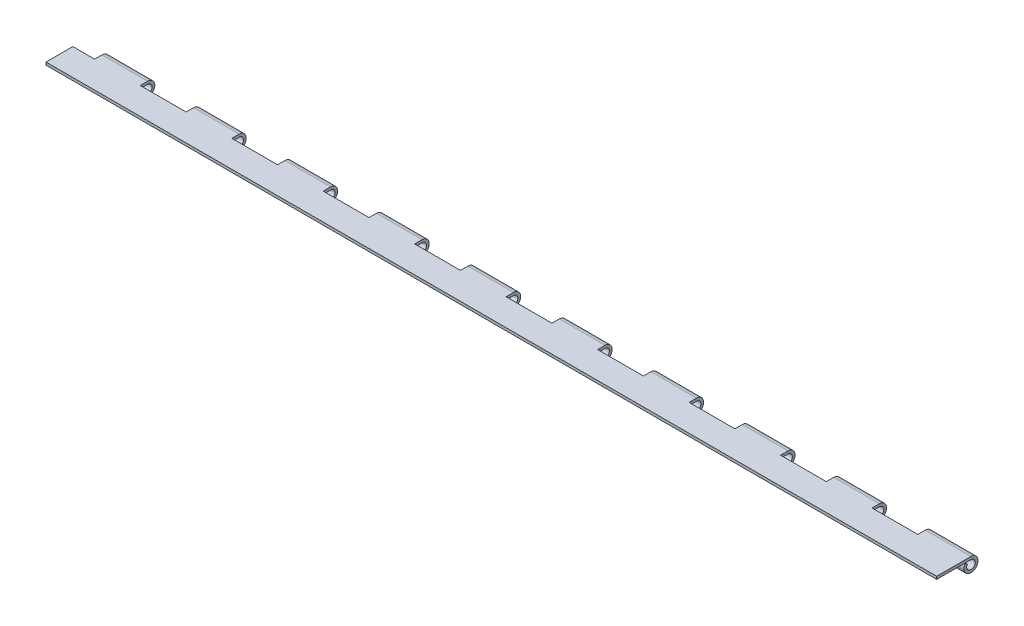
ISO-10303-21;
HEADER;
FILE_DESCRIPTION(('STEP AP214'),'2;1');
FILE_NAME('part.step','',(''),(''),'','','');
FILE_SCHEMA(('AUTOMOTIVE_DESIGN { 1 0 10303 214 1 1 1 1 }'));
ENDSEC;
DATA;
#1=APPLICATION_CONTEXT('core data for automotive mechanical design processes');
#2=APPLICATION_PROTOCOL_DEFINITION('international standard','automotive_design',2000,#1);
#3=PRODUCT_CONTEXT('',#1,'mechanical');
#4=PRODUCT('Part','Part','',(#3));
#5=PRODUCT_RELATED_PRODUCT_CATEGORY('part','',(#4));
#6=PRODUCT_DEFINITION_FORMATION('','',#4);
#7=PRODUCT_DEFINITION_CONTEXT('part definition',#1,'design');
#8=PRODUCT_DEFINITION('design','',#6,#7);
#9=PRODUCT_DEFINITION_SHAPE('','',#8);
#10=(LENGTH_UNIT() NAMED_UNIT(*) SI_UNIT(.MILLI.,.METRE.));
#11=(NAMED_UNIT(*) PLANE_ANGLE_UNIT() SI_UNIT($,.RADIAN.));
#12=(NAMED_UNIT(*) SI_UNIT($,.STERADIAN.) SOLID_ANGLE_UNIT());
#13=UNCERTAINTY_MEASURE_WITH_UNIT(LENGTH_MEASURE(1.E-05),#10,'distance_accuracy_value','');
#14=(GEOMETRIC_REPRESENTATION_CONTEXT(3) GLOBAL_UNCERTAINTY_ASSIGNED_CONTEXT((#13)) GLOBAL_UNIT_ASSIGNED_CONTEXT((#10,
#11,#12)) REPRESENTATION_CONTEXT('',''));
#15=CARTESIAN_POINT('',(0.,0.,0.));
#16=DIRECTION('',(0.,0.,1.));
#17=DIRECTION('',(1.,0.,0.));
#18=AXIS2_PLACEMENT_3D('',#15,#16,#17);
#19=CARTESIAN_POINT('',(1219.2,0.,0.));
#20=DIRECTION('',(-1.,0.,0.));
#21=DIRECTION('',(0.,0.,1.));
#22=AXIS2_PLACEMENT_3D('',#19,#20,#21);
#23=CYLINDRICAL_SURFACE('',#22,4.78250228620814);
#24=DIRECTION('',(-1.,0.,0.));
#25=VECTOR('',#24,1.);
#26=CARTESIAN_POINT('',(1219.2,4.78250228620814,0.));
#27=LINE('',#26,#25);
#28=CARTESIAN_POINT('',(303.657000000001,4.78250228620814,0.));
#29=VERTEX_POINT('',#28);
#30=CARTESIAN_POINT('',(252.857000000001,4.78250228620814,0.));
#31=VERTEX_POINT('',#30);
#32=EDGE_CURVE('E461',#29,#31,#27,.T.);
#33=ORIENTED_EDGE('',*,*,#32,.T.);
#34=CARTESIAN_POINT('',(252.857000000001,0.,0.));
#35=DIRECTION('',(1.,0.,0.));
#36=DIRECTION('',(0.,0.,-1.));
#37=AXIS2_PLACEMENT_3D('',#34,#35,#36);
#38=CIRCLE('',#37,4.78250228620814);
#39=CARTESIAN_POINT('',(252.857000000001,2.47113420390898,4.09460912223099));
#40=VERTEX_POINT('',#39);
#41=EDGE_CURVE('E521',#31,#40,#38,.F.);
#42=ORIENTED_EDGE('',*,*,#41,.T.);
#43=DIRECTION('',(-1.,0.,0.));
#44=VECTOR('',#43,1.);
#45=CARTESIAN_POINT('',(1219.2,2.47113420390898,4.09460912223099));
#46=LINE('',#45,#44);
#47=CARTESIAN_POINT('',(303.657000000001,2.47113420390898,4.09460912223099));
#48=VERTEX_POINT('',#47);
#49=EDGE_CURVE('E456',#48,#40,#46,.T.);
#50=ORIENTED_EDGE('',*,*,#49,.F.);
#51=CARTESIAN_POINT('',(303.657000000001,0.,0.));
#52=DIRECTION('',(-1.,0.,0.));
#53=DIRECTION('',(0.,0.,1.));
#54=AXIS2_PLACEMENT_3D('',#51,#52,#53);
#55=CIRCLE('',#54,4.78250228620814);
#56=EDGE_CURVE('E536',#48,#29,#55,.F.);
#57=ORIENTED_EDGE('',*,*,#56,.T.);
#58=EDGE_LOOP('',(#33,#42,#50,#57));
#59=FACE_BOUND('',#58,.T.);
#60=ADVANCED_FACE('F31',(#59),#23,.F.);
#61=CARTESIAN_POINT('',(1219.2,2.47113420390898,4.09460912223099));
#62=DIRECTION('',(0.,-0.856164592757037,0.516703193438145));
#63=DIRECTION('',(0.,-0.516703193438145,-0.856164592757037));
#64=AXIS2_PLACEMENT_3D('',#61,#62,#63);
#65=PLANE('',#64);
#66=ORIENTED_EDGE('',*,*,#49,.T.);
#67=DIRECTION('',(0.,0.516703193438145,0.856164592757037));
#68=VECTOR('',#67,1.);
#69=CARTESIAN_POINT('',(252.857000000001,2.47113420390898,4.09460912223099));
#70=LINE('',#69,#68);
#71=CARTESIAN_POINT('',(252.857000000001,4.04604553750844,6.70419880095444));
#72=VERTEX_POINT('',#71);
#73=EDGE_CURVE('E519',#40,#72,#70,.T.);
#74=ORIENTED_EDGE('',*,*,#73,.T.);
#75=DIRECTION('',(-1.,0.,0.));
#76=VECTOR('',#75,1.);
#77=CARTESIAN_POINT('',(1219.2,4.04604553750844,6.70419880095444));
#78=LINE('',#77,#76);
#79=CARTESIAN_POINT('',(303.657000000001,4.04604553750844,6.70419880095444));
#80=VERTEX_POINT('',#79);
#81=EDGE_CURVE('E451',#80,#72,#78,.T.);
#82=ORIENTED_EDGE('',*,*,#81,.F.);
#83=DIRECTION('',(0.,-0.516703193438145,-0.856164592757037));
#84=VECTOR('',#83,1.);
#85=CARTESIAN_POINT('',(303.657000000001,2.47113420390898,4.09460912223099));
#86=LINE('',#85,#84);
#87=EDGE_CURVE('E532',#80,#48,#86,.T.);
#88=ORIENTED_EDGE('',*,*,#87,.T.);
#89=EDGE_LOOP('',(#66,#74,#82,#88));
#90=FACE_BOUND('',#89,.T.);
#91=ADVANCED_FACE('F1013',(#90),#65,.F.);
#92=CARTESIAN_POINT('',(1219.2,0.,0.));
#93=DIRECTION('',(-1.,0.,0.));
#94=DIRECTION('',(0.,0.,1.));
#95=AXIS2_PLACEMENT_3D('',#92,#93,#94);
#96=CYLINDRICAL_SURFACE('',#95,7.83050228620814);
#97=ORIENTED_EDGE('',*,*,#81,.T.);
#98=CARTESIAN_POINT('',(252.857000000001,0.,0.));
#99=DIRECTION('',(1.,0.,0.));
#100=DIRECTION('',(0.,0.,-1.));
#101=AXIS2_PLACEMENT_3D('',#98,#99,#100);
#102=CIRCLE('',#101,7.83050228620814);
#103=CARTESIAN_POINT('',(252.857000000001,7.83050228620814,0.));
#104=VERTEX_POINT('',#103);
#105=EDGE_CURVE('E499',#72,#104,#102,.T.);
#106=ORIENTED_EDGE('',*,*,#105,.T.);
#107=DIRECTION('',(-1.,0.,0.));
#108=VECTOR('',#107,1.);
#109=CARTESIAN_POINT('',(1219.2,7.83050228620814,0.));
#110=LINE('',#109,#108);
#111=CARTESIAN_POINT('',(303.657000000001,7.83050228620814,0.));
#112=VERTEX_POINT('',#111);
#113=EDGE_CURVE('E440',#112,#104,#110,.T.);
#114=ORIENTED_EDGE('',*,*,#113,.F.);
#115=CARTESIAN_POINT('',(303.657000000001,0.,0.));
#116=DIRECTION('',(-1.,0.,0.));
#117=DIRECTION('',(0.,0.,1.));
#118=AXIS2_PLACEMENT_3D('',#115,#116,#117);
#119=CIRCLE('',#118,7.83050228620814);
#120=EDGE_CURVE('E53',#112,#80,#119,.T.);
#121=ORIENTED_EDGE('',*,*,#120,.T.);
#122=EDGE_LOOP('',(#97,#106,#114,#121));
#123=FACE_BOUND('',#122,.T.);
#124=ADVANCED_FACE('F498',(#123),#96,.T.);
#125=CARTESIAN_POINT('',(405.384000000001,4.78250228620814,0.));
#126=VERTEX_POINT('',#125);
#127=CARTESIAN_POINT('',(354.584000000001,4.78250228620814,0.));
#128=VERTEX_POINT('',#127);
#129=EDGE_CURVE('E924',#126,#128,#27,.T.);
#130=ORIENTED_EDGE('',*,*,#129,.T.);
#131=CARTESIAN_POINT('',(354.584000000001,0.,0.));
#132=DIRECTION('',(1.,0.,0.));
#133=DIRECTION('',(0.,0.,-1.));
#134=AXIS2_PLACEMENT_3D('',#131,#132,#133);
#135=CIRCLE('',#134,4.78250228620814);
#136=CARTESIAN_POINT('',(354.584000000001,2.47113420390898,4.09460912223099));
#137=VERTEX_POINT('',#136);
#138=EDGE_CURVE('E549',#128,#137,#135,.F.);
#139=ORIENTED_EDGE('',*,*,#138,.T.);
#140=CARTESIAN_POINT('',(405.384000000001,2.47113420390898,4.09460912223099));
#141=VERTEX_POINT('',#140);
#142=EDGE_CURVE('E1004',#141,#137,#46,.T.);
#143=ORIENTED_EDGE('',*,*,#142,.F.);
#144=CARTESIAN_POINT('',(405.384000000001,0.,0.));
#145=DIRECTION('',(-1.,0.,0.));
#146=DIRECTION('',(0.,0.,1.));
#147=AXIS2_PLACEMENT_3D('',#144,#145,#146);
#148=CIRCLE('',#147,4.78250228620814);
#149=EDGE_CURVE('E570',#141,#126,#148,.F.);
#150=ORIENTED_EDGE('',*,*,#149,.T.);
#151=EDGE_LOOP('',(#130,#139,#143,#150));
#152=FACE_BOUND('',#151,.T.);
#153=ADVANCED_FACE('F1026',(#152),#23,.F.);
#154=ORIENTED_EDGE('',*,*,#142,.T.);
#155=DIRECTION('',(0.,0.516703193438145,0.856164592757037));
#156=VECTOR('',#155,1.);
#157=CARTESIAN_POINT('',(354.584000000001,2.47113420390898,4.09460912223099));
#158=LINE('',#157,#156);
#159=CARTESIAN_POINT('',(354.584000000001,4.04604553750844,6.70419880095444));
#160=VERTEX_POINT('',#159);
#161=EDGE_CURVE('E546',#137,#160,#158,.T.);
#162=ORIENTED_EDGE('',*,*,#161,.T.);
#163=CARTESIAN_POINT('',(405.384000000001,4.04604553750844,6.70419880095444));
#164=VERTEX_POINT('',#163);
#165=EDGE_CURVE('E914',#164,#160,#78,.T.);
#166=ORIENTED_EDGE('',*,*,#165,.F.);
#167=DIRECTION('',(0.,-0.516703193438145,-0.856164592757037));
#168=VECTOR('',#167,1.);
#169=CARTESIAN_POINT('',(405.384000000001,2.47113420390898,4.09460912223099));
#170=LINE('',#169,#168);
#171=EDGE_CURVE('E566',#164,#141,#170,.T.);
#172=ORIENTED_EDGE('',*,*,#171,.T.);
#173=EDGE_LOOP('',(#154,#162,#166,#172));
#174=FACE_BOUND('',#173,.T.);
#175=ADVANCED_FACE('F1031',(#174),#65,.F.);
#176=ORIENTED_EDGE('',*,*,#165,.T.);
#177=CARTESIAN_POINT('',(354.584000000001,0.,0.));
#178=DIRECTION('',(1.,0.,0.));
#179=DIRECTION('',(0.,0.,-1.));
#180=AXIS2_PLACEMENT_3D('',#177,#178,#179);
#181=CIRCLE('',#180,7.83050228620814);
#182=CARTESIAN_POINT('',(354.584000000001,7.83050228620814,0.));
#183=VERTEX_POINT('',#182);
#184=EDGE_CURVE('E555',#160,#183,#181,.T.);
#185=ORIENTED_EDGE('',*,*,#184,.T.);
#186=CARTESIAN_POINT('',(405.384000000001,7.83050228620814,0.));
#187=VERTEX_POINT('',#186);
#188=EDGE_CURVE('E444',#187,#183,#110,.T.);
#189=ORIENTED_EDGE('',*,*,#188,.F.);
#190=CARTESIAN_POINT('',(405.384000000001,0.,0.));
#191=DIRECTION('',(-1.,0.,0.));
#192=DIRECTION('',(0.,0.,1.));
#193=AXIS2_PLACEMENT_3D('',#190,#191,#192);
#194=CIRCLE('',#193,7.83050228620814);
#195=EDGE_CURVE('E576',#187,#164,#194,.T.);
#196=ORIENTED_EDGE('',*,*,#195,.T.);
#197=EDGE_LOOP('',(#176,#185,#189,#196));
#198=FACE_BOUND('',#197,.T.);
#199=ADVANCED_FACE('F911',(#198),#96,.T.);
#200=CARTESIAN_POINT('',(507.111000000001,4.78250228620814,0.));
#201=VERTEX_POINT('',#200);
#202=CARTESIAN_POINT('',(456.311000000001,4.78250228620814,0.));
#203=VERTEX_POINT('',#202);
#204=EDGE_CURVE('E926',#201,#203,#27,.T.);
#205=ORIENTED_EDGE('',*,*,#204,.T.);
#206=CARTESIAN_POINT('',(456.311000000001,0.,0.));
#207=DIRECTION('',(1.,0.,0.));
#208=DIRECTION('',(0.,0.,-1.));
#209=AXIS2_PLACEMENT_3D('',#206,#207,#208);
#210=CIRCLE('',#209,4.78250228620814);
#211=CARTESIAN_POINT('',(456.311000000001,2.47113420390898,4.09460912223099));
#212=VERTEX_POINT('',#211);
#213=EDGE_CURVE('E584',#203,#212,#210,.F.);
#214=ORIENTED_EDGE('',*,*,#213,.T.);
#215=CARTESIAN_POINT('',(507.111000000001,2.47113420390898,4.09460912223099));
#216=VERTEX_POINT('',#215);
#217=EDGE_CURVE('E999',#216,#212,#46,.T.);
#218=ORIENTED_EDGE('',*,*,#217,.F.);
#219=CARTESIAN_POINT('',(507.111000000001,0.,0.));
#220=DIRECTION('',(-1.,0.,0.));
#221=DIRECTION('',(0.,0.,1.));
#222=AXIS2_PLACEMENT_3D('',#219,#220,#221);
#223=CIRCLE('',#222,4.78250228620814);
#224=EDGE_CURVE('E605',#216,#201,#223,.F.);
#225=ORIENTED_EDGE('',*,*,#224,.T.);
#226=EDGE_LOOP('',(#205,#214,#218,#225));
#227=FACE_BOUND('',#226,.T.);
#228=ADVANCED_FACE('F1002',(#227),#23,.F.);
#229=ORIENTED_EDGE('',*,*,#217,.T.);
#230=DIRECTION('',(0.,0.516703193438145,0.856164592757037));
#231=VECTOR('',#230,1.);
#232=CARTESIAN_POINT('',(456.311000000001,2.47113420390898,4.09460912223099));
#233=LINE('',#232,#231);
#234=CARTESIAN_POINT('',(456.311000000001,4.04604553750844,6.70419880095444));
#235=VERTEX_POINT('',#234);
#236=EDGE_CURVE('E581',#212,#235,#233,.T.);
#237=ORIENTED_EDGE('',*,*,#236,.T.);
#238=CARTESIAN_POINT('',(507.111000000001,4.04604553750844,6.70419880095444));
#239=VERTEX_POINT('',#238);
#240=EDGE_CURVE('E987',#239,#235,#78,.T.);
#241=ORIENTED_EDGE('',*,*,#240,.F.);
#242=DIRECTION('',(0.,-0.516703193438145,-0.856164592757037));
#243=VECTOR('',#242,1.);
#244=CARTESIAN_POINT('',(507.111000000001,2.47113420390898,4.09460912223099));
#245=LINE('',#244,#243);
#246=EDGE_CURVE('E601',#239,#216,#245,.T.);
#247=ORIENTED_EDGE('',*,*,#246,.T.);
#248=EDGE_LOOP('',(#229,#237,#241,#247));
#249=FACE_BOUND('',#248,.T.);
#250=ADVANCED_FACE('F997',(#249),#65,.F.);
#251=ORIENTED_EDGE('',*,*,#240,.T.);
#252=CARTESIAN_POINT('',(456.311000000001,0.,0.));
#253=DIRECTION('',(1.,0.,0.));
#254=DIRECTION('',(0.,0.,-1.));
#255=AXIS2_PLACEMENT_3D('',#252,#253,#254);
#256=CIRCLE('',#255,7.83050228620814);
#257=CARTESIAN_POINT('',(456.311000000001,7.83050228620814,0.));
#258=VERTEX_POINT('',#257);
#259=EDGE_CURVE('E590',#235,#258,#256,.T.);
#260=ORIENTED_EDGE('',*,*,#259,.T.);
#261=CARTESIAN_POINT('',(507.111000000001,7.83050228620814,0.));
#262=VERTEX_POINT('',#261);
#263=EDGE_CURVE('E899',#262,#258,#110,.T.);
#264=ORIENTED_EDGE('',*,*,#263,.F.);
#265=CARTESIAN_POINT('',(507.111000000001,0.,0.));
#266=DIRECTION('',(-1.,0.,0.));
#267=DIRECTION('',(0.,0.,1.));
#268=AXIS2_PLACEMENT_3D('',#265,#266,#267);
#269=CIRCLE('',#268,7.83050228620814);
#270=EDGE_CURVE('E611',#262,#239,#269,.T.);
#271=ORIENTED_EDGE('',*,*,#270,.T.);
#272=EDGE_LOOP('',(#251,#260,#264,#271));
#273=FACE_BOUND('',#272,.T.);
#274=ADVANCED_FACE('F993',(#273),#96,.T.);
#275=CARTESIAN_POINT('',(608.838000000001,4.78250228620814,0.));
#276=VERTEX_POINT('',#275);
#277=CARTESIAN_POINT('',(558.038000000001,4.78250228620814,0.));
#278=VERTEX_POINT('',#277);
#279=EDGE_CURVE('E930',#276,#278,#27,.T.);
#280=ORIENTED_EDGE('',*,*,#279,.T.);
#281=CARTESIAN_POINT('',(558.038000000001,0.,0.));
#282=DIRECTION('',(1.,0.,0.));
#283=DIRECTION('',(0.,0.,-1.));
#284=AXIS2_PLACEMENT_3D('',#281,#282,#283);
#285=CIRCLE('',#284,4.78250228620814);
#286=CARTESIAN_POINT('',(558.038000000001,2.47113420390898,4.09460912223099));
#287=VERTEX_POINT('',#286);
#288=EDGE_CURVE('E619',#278,#287,#285,.F.);
#289=ORIENTED_EDGE('',*,*,#288,.T.);
#290=CARTESIAN_POINT('',(608.838000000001,2.47113420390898,4.09460912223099));
#291=VERTEX_POINT('',#290);
#292=EDGE_CURVE('E1003',#291,#287,#46,.T.);
#293=ORIENTED_EDGE('',*,*,#292,.F.);
#294=CARTESIAN_POINT('',(608.838000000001,0.,0.));
#295=DIRECTION('',(-1.,0.,0.));
#296=DIRECTION('',(0.,0.,1.));
#297=AXIS2_PLACEMENT_3D('',#294,#295,#296);
#298=CIRCLE('',#297,4.78250228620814);
#299=EDGE_CURVE('E640',#291,#276,#298,.F.);
#300=ORIENTED_EDGE('',*,*,#299,.T.);
#301=EDGE_LOOP('',(#280,#289,#293,#300));
#302=FACE_BOUND('',#301,.T.);
#303=ADVANCED_FACE('F1075',(#302),#23,.F.);
#304=ORIENTED_EDGE('',*,*,#292,.T.);
#305=DIRECTION('',(0.,0.516703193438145,0.856164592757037));
#306=VECTOR('',#305,1.);
#307=CARTESIAN_POINT('',(558.038000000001,2.47113420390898,4.09460912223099));
#308=LINE('',#307,#306);
#309=CARTESIAN_POINT('',(558.038000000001,4.04604553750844,6.70419880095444));
#310=VERTEX_POINT('',#309);
#311=EDGE_CURVE('E616',#287,#310,#308,.T.);
#312=ORIENTED_EDGE('',*,*,#311,.T.);
#313=CARTESIAN_POINT('',(608.838000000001,4.04604553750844,6.70419880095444));
#314=VERTEX_POINT('',#313);
#315=EDGE_CURVE('E983',#314,#310,#78,.T.);
#316=ORIENTED_EDGE('',*,*,#315,.F.);
#317=DIRECTION('',(0.,-0.516703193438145,-0.856164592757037));
#318=VECTOR('',#317,1.);
#319=CARTESIAN_POINT('',(608.838000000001,2.47113420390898,4.09460912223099));
#320=LINE('',#319,#318);
#321=EDGE_CURVE('E636',#314,#291,#320,.T.);
#322=ORIENTED_EDGE('',*,*,#321,.T.);
#323=EDGE_LOOP('',(#304,#312,#316,#322));
#324=FACE_BOUND('',#323,.T.);
#325=ADVANCED_FACE('F1081',(#324),#65,.F.);
#326=ORIENTED_EDGE('',*,*,#315,.T.);
#327=CARTESIAN_POINT('',(558.038000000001,0.,0.));
#328=DIRECTION('',(1.,0.,0.));
#329=DIRECTION('',(0.,0.,-1.));
#330=AXIS2_PLACEMENT_3D('',#327,#328,#329);
#331=CIRCLE('',#330,7.83050228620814);
#332=CARTESIAN_POINT('',(558.038000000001,7.83050228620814,0.));
#333=VERTEX_POINT('',#332);
#334=EDGE_CURVE('E625',#310,#333,#331,.T.);
#335=ORIENTED_EDGE('',*,*,#334,.T.);
#336=CARTESIAN_POINT('',(608.838000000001,7.83050228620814,0.));
#337=VERTEX_POINT('',#336);
#338=EDGE_CURVE('E895',#337,#333,#110,.T.);
#339=ORIENTED_EDGE('',*,*,#338,.F.);
#340=CARTESIAN_POINT('',(608.838000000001,0.,0.));
#341=DIRECTION('',(-1.,0.,0.));
#342=DIRECTION('',(0.,0.,1.));
#343=AXIS2_PLACEMENT_3D('',#340,#341,#342);
#344=CIRCLE('',#343,7.83050228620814);
#345=EDGE_CURVE('E646',#337,#314,#344,.T.);
#346=ORIENTED_EDGE('',*,*,#345,.T.);
#347=EDGE_LOOP('',(#326,#335,#339,#346));
#348=FACE_BOUND('',#347,.T.);
#349=ADVANCED_FACE('F1073',(#348),#96,.T.);
#350=CARTESIAN_POINT('',(710.565000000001,4.78250228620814,0.));
#351=VERTEX_POINT('',#350);
#352=CARTESIAN_POINT('',(659.765000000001,4.78250228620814,0.));
#353=VERTEX_POINT('',#352);
#354=EDGE_CURVE('E934',#351,#353,#27,.T.);
#355=ORIENTED_EDGE('',*,*,#354,.T.);
#356=CARTESIAN_POINT('',(659.765000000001,0.,0.));
#357=DIRECTION('',(1.,0.,0.));
#358=DIRECTION('',(0.,0.,-1.));
#359=AXIS2_PLACEMENT_3D('',#356,#357,#358);
#360=CIRCLE('',#359,4.78250228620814);
#361=CARTESIAN_POINT('',(659.765000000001,2.47113420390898,4.09460912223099));
#362=VERTEX_POINT('',#361);
#363=EDGE_CURVE('E654',#353,#362,#360,.F.);
#364=ORIENTED_EDGE('',*,*,#363,.T.);
#365=CARTESIAN_POINT('',(710.565000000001,2.47113420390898,4.09460912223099));
#366=VERTEX_POINT('',#365);
#367=EDGE_CURVE('E1006',#366,#362,#46,.T.);
#368=ORIENTED_EDGE('',*,*,#367,.F.);
#369=CARTESIAN_POINT('',(710.565000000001,0.,0.));
#370=DIRECTION('',(-1.,0.,0.));
#371=DIRECTION('',(0.,0.,1.));
#372=AXIS2_PLACEMENT_3D('',#369,#370,#371);
#373=CIRCLE('',#372,4.78250228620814);
#374=EDGE_CURVE('E675',#366,#351,#373,.F.);
#375=ORIENTED_EDGE('',*,*,#374,.T.);
#376=EDGE_LOOP('',(#355,#364,#368,#375));
#377=FACE_BOUND('',#376,.T.);
#378=ADVANCED_FACE('F1066',(#377),#23,.F.);
#379=ORIENTED_EDGE('',*,*,#367,.T.);
#380=DIRECTION('',(0.,0.516703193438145,0.856164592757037));
#381=VECTOR('',#380,1.);
#382=CARTESIAN_POINT('',(659.765000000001,2.47113420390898,4.09460912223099));
#383=LINE('',#382,#381);
#384=CARTESIAN_POINT('',(659.765000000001,4.04604553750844,6.70419880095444));
#385=VERTEX_POINT('',#384);
#386=EDGE_CURVE('E651',#362,#385,#383,.T.);
#387=ORIENTED_EDGE('',*,*,#386,.T.);
#388=CARTESIAN_POINT('',(710.565000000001,4.04604553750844,6.70419880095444));
#389=VERTEX_POINT('',#388);
#390=EDGE_CURVE('E979',#389,#385,#78,.T.);
#391=ORIENTED_EDGE('',*,*,#390,.F.);
#392=DIRECTION('',(0.,-0.516703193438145,-0.856164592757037));
#393=VECTOR('',#392,1.);
#394=CARTESIAN_POINT('',(710.565000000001,2.47113420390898,4.09460912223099));
#395=LINE('',#394,#393);
#396=EDGE_CURVE('E671',#389,#366,#395,.T.);
#397=ORIENTED_EDGE('',*,*,#396,.T.);
#398=EDGE_LOOP('',(#379,#387,#391,#397));
#399=FACE_BOUND('',#398,.T.);
#400=ADVANCED_FACE('F1072',(#399),#65,.F.);
#401=ORIENTED_EDGE('',*,*,#390,.T.);
#402=CARTESIAN_POINT('',(659.765000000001,0.,0.));
#403=DIRECTION('',(1.,0.,0.));
#404=DIRECTION('',(0.,0.,-1.));
#405=AXIS2_PLACEMENT_3D('',#402,#403,#404);
#406=CIRCLE('',#405,7.83050228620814);
#407=CARTESIAN_POINT('',(659.765000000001,7.83050228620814,0.));
#408=VERTEX_POINT('',#407);
#409=EDGE_CURVE('E660',#385,#408,#406,.T.);
#410=ORIENTED_EDGE('',*,*,#409,.T.);
#411=CARTESIAN_POINT('',(710.565000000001,7.83050228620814,0.));
#412=VERTEX_POINT('',#411);
#413=EDGE_CURVE('E891',#412,#408,#110,.T.);
#414=ORIENTED_EDGE('',*,*,#413,.F.);
#415=CARTESIAN_POINT('',(710.565000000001,0.,0.));
#416=DIRECTION('',(-1.,0.,0.));
#417=DIRECTION('',(0.,0.,1.));
#418=AXIS2_PLACEMENT_3D('',#415,#416,#417);
#419=CIRCLE('',#418,7.83050228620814);
#420=EDGE_CURVE('E681',#412,#389,#419,.T.);
#421=ORIENTED_EDGE('',*,*,#420,.T.);
#422=EDGE_LOOP('',(#401,#410,#414,#421));
#423=FACE_BOUND('',#422,.T.);
#424=ADVANCED_FACE('F1064',(#423),#96,.T.);
#425=CARTESIAN_POINT('',(812.292,4.78250228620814,0.));
#426=VERTEX_POINT('',#425);
#427=CARTESIAN_POINT('',(761.492000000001,4.78250228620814,0.));
#428=VERTEX_POINT('',#427);
#429=EDGE_CURVE('E938',#426,#428,#27,.T.);
#430=ORIENTED_EDGE('',*,*,#429,.T.);
#431=CARTESIAN_POINT('',(761.492000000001,0.,0.));
#432=DIRECTION('',(1.,0.,0.));
#433=DIRECTION('',(0.,0.,-1.));
#434=AXIS2_PLACEMENT_3D('',#431,#432,#433);
#435=CIRCLE('',#434,4.78250228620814);
#436=CARTESIAN_POINT('',(761.492000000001,2.47113420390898,4.09460912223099));
#437=VERTEX_POINT('',#436);
#438=EDGE_CURVE('E689',#428,#437,#435,.F.);
#439=ORIENTED_EDGE('',*,*,#438,.T.);
#440=CARTESIAN_POINT('',(812.292,2.47113420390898,4.09460912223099));
#441=VERTEX_POINT('',#440);
#442=EDGE_CURVE('E1592',#441,#437,#46,.T.);
#443=ORIENTED_EDGE('',*,*,#442,.F.);
#444=CARTESIAN_POINT('',(812.292,0.,0.));
#445=DIRECTION('',(-1.,0.,0.));
#446=DIRECTION('',(0.,0.,1.));
#447=AXIS2_PLACEMENT_3D('',#444,#445,#446);
#448=CIRCLE('',#447,4.78250228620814);
#449=EDGE_CURVE('E710',#441,#426,#448,.F.);
#450=ORIENTED_EDGE('',*,*,#449,.T.);
#451=EDGE_LOOP('',(#430,#439,#443,#450));
#452=FACE_BOUND('',#451,.T.);
#453=ADVANCED_FACE('F1057',(#452),#23,.F.);
#454=ORIENTED_EDGE('',*,*,#442,.T.);
#455=DIRECTION('',(0.,0.516703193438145,0.856164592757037));
#456=VECTOR('',#455,1.);
#457=CARTESIAN_POINT('',(761.492000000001,2.47113420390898,4.09460912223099));
#458=LINE('',#457,#456);
#459=CARTESIAN_POINT('',(761.492000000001,4.04604553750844,6.70419880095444));
#460=VERTEX_POINT('',#459);
#461=EDGE_CURVE('E686',#437,#460,#458,.T.);
#462=ORIENTED_EDGE('',*,*,#461,.T.);
#463=CARTESIAN_POINT('',(812.292,4.04604553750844,6.70419880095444));
#464=VERTEX_POINT('',#463);
#465=EDGE_CURVE('E975',#464,#460,#78,.T.);
#466=ORIENTED_EDGE('',*,*,#465,.F.);
#467=DIRECTION('',(0.,-0.516703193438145,-0.856164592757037));
#468=VECTOR('',#467,1.);
#469=CARTESIAN_POINT('',(812.292,2.47113420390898,4.09460912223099));
#470=LINE('',#469,#468);
#471=EDGE_CURVE('E706',#464,#441,#470,.T.);
#472=ORIENTED_EDGE('',*,*,#471,.T.);
#473=EDGE_LOOP('',(#454,#462,#466,#472));
#474=FACE_BOUND('',#473,.T.);
#475=ADVANCED_FACE('F1063',(#474),#65,.F.);
#476=ORIENTED_EDGE('',*,*,#465,.T.);
#477=CARTESIAN_POINT('',(761.492000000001,0.,0.));
#478=DIRECTION('',(1.,0.,0.));
#479=DIRECTION('',(0.,0.,-1.));
#480=AXIS2_PLACEMENT_3D('',#477,#478,#479);
#481=CIRCLE('',#480,7.83050228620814);
#482=CARTESIAN_POINT('',(761.492000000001,7.83050228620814,0.));
#483=VERTEX_POINT('',#482);
#484=EDGE_CURVE('E695',#460,#483,#481,.T.);
#485=ORIENTED_EDGE('',*,*,#484,.T.);
#486=CARTESIAN_POINT('',(812.292000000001,7.83050228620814,0.));
#487=VERTEX_POINT('',#486);
#488=EDGE_CURVE('E887',#487,#483,#110,.T.);
#489=ORIENTED_EDGE('',*,*,#488,.F.);
#490=CARTESIAN_POINT('',(812.292,0.,0.));
#491=DIRECTION('',(-1.,0.,0.));
#492=DIRECTION('',(0.,0.,1.));
#493=AXIS2_PLACEMENT_3D('',#490,#491,#492);
#494=CIRCLE('',#493,7.83050228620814);
#495=EDGE_CURVE('E716',#487,#464,#494,.T.);
#496=ORIENTED_EDGE('',*,*,#495,.T.);
#497=EDGE_LOOP('',(#476,#485,#489,#496));
#498=FACE_BOUND('',#497,.T.);
#499=ADVANCED_FACE('F1055',(#498),#96,.T.);
#500=CARTESIAN_POINT('',(914.019,4.78250228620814,0.));
#501=VERTEX_POINT('',#500);
#502=CARTESIAN_POINT('',(863.219,4.78250228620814,0.));
#503=VERTEX_POINT('',#502);
#504=EDGE_CURVE('E942',#501,#503,#27,.T.);
#505=ORIENTED_EDGE('',*,*,#504,.T.);
#506=CARTESIAN_POINT('',(863.219,0.,0.));
#507=DIRECTION('',(1.,0.,0.));
#508=DIRECTION('',(0.,0.,-1.));
#509=AXIS2_PLACEMENT_3D('',#506,#507,#508);
#510=CIRCLE('',#509,4.78250228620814);
#511=CARTESIAN_POINT('',(863.219,2.47113420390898,4.09460912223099));
#512=VERTEX_POINT('',#511);
#513=EDGE_CURVE('E724',#503,#512,#510,.F.);
#514=ORIENTED_EDGE('',*,*,#513,.T.);
#515=CARTESIAN_POINT('',(914.019,2.47113420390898,4.09460912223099));
#516=VERTEX_POINT('',#515);
#517=EDGE_CURVE('E1594',#516,#512,#46,.T.);
#518=ORIENTED_EDGE('',*,*,#517,.F.);
#519=CARTESIAN_POINT('',(914.019,0.,0.));
#520=DIRECTION('',(-1.,0.,0.));
#521=DIRECTION('',(0.,0.,1.));
#522=AXIS2_PLACEMENT_3D('',#519,#520,#521);
#523=CIRCLE('',#522,4.78250228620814);
#524=EDGE_CURVE('E745',#516,#501,#523,.F.);
#525=ORIENTED_EDGE('',*,*,#524,.T.);
#526=EDGE_LOOP('',(#505,#514,#518,#525));
#527=FACE_BOUND('',#526,.T.);
#528=ADVANCED_FACE('F1048',(#527),#23,.F.);
#529=ORIENTED_EDGE('',*,*,#517,.T.);
#530=DIRECTION('',(0.,0.516703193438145,0.856164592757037));
#531=VECTOR('',#530,1.);
#532=CARTESIAN_POINT('',(863.219,2.47113420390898,4.09460912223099));
#533=LINE('',#532,#531);
#534=CARTESIAN_POINT('',(863.219,4.04604553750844,6.70419880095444));
#535=VERTEX_POINT('',#534);
#536=EDGE_CURVE('E721',#512,#535,#533,.T.);
#537=ORIENTED_EDGE('',*,*,#536,.T.);
#538=CARTESIAN_POINT('',(914.019,4.04604553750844,6.70419880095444));
#539=VERTEX_POINT('',#538);
#540=EDGE_CURVE('E971',#539,#535,#78,.T.);
#541=ORIENTED_EDGE('',*,*,#540,.F.);
#542=DIRECTION('',(0.,-0.516703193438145,-0.856164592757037));
#543=VECTOR('',#542,1.);
#544=CARTESIAN_POINT('',(914.019,2.47113420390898,4.09460912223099));
#545=LINE('',#544,#543);
#546=EDGE_CURVE('E741',#539,#516,#545,.T.);
#547=ORIENTED_EDGE('',*,*,#546,.T.);
#548=EDGE_LOOP('',(#529,#537,#541,#547));
#549=FACE_BOUND('',#548,.T.);
#550=ADVANCED_FACE('F1054',(#549),#65,.F.);
#551=ORIENTED_EDGE('',*,*,#540,.T.);
#552=CARTESIAN_POINT('',(863.219,0.,0.));
#553=DIRECTION('',(1.,0.,0.));
#554=DIRECTION('',(0.,0.,-1.));
#555=AXIS2_PLACEMENT_3D('',#552,#553,#554);
#556=CIRCLE('',#555,7.83050228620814);
#557=CARTESIAN_POINT('',(863.219,7.83050228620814,0.));
#558=VERTEX_POINT('',#557);
#559=EDGE_CURVE('E730',#535,#558,#556,.T.);
#560=ORIENTED_EDGE('',*,*,#559,.T.);
#561=CARTESIAN_POINT('',(914.019,7.83050228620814,0.));
#562=VERTEX_POINT('',#561);
#563=EDGE_CURVE('E883',#562,#558,#110,.T.);
#564=ORIENTED_EDGE('',*,*,#563,.F.);
#565=CARTESIAN_POINT('',(914.019,0.,0.));
#566=DIRECTION('',(-1.,0.,0.));
#567=DIRECTION('',(0.,0.,1.));
#568=AXIS2_PLACEMENT_3D('',#565,#566,#567);
#569=CIRCLE('',#568,7.83050228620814);
#570=EDGE_CURVE('E751',#562,#539,#569,.T.);
#571=ORIENTED_EDGE('',*,*,#570,.T.);
#572=EDGE_LOOP('',(#551,#560,#564,#571));
#573=FACE_BOUND('',#572,.T.);
#574=ADVANCED_FACE('F1046',(#573),#96,.T.);
#575=CARTESIAN_POINT('',(1015.746,4.78250228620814,0.));
#576=VERTEX_POINT('',#575);
#577=CARTESIAN_POINT('',(964.946,4.78250228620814,0.));
#578=VERTEX_POINT('',#577);
#579=EDGE_CURVE('E946',#576,#578,#27,.T.);
#580=ORIENTED_EDGE('',*,*,#579,.T.);
#581=CARTESIAN_POINT('',(964.946,0.,0.));
#582=DIRECTION('',(1.,0.,0.));
#583=DIRECTION('',(0.,0.,-1.));
#584=AXIS2_PLACEMENT_3D('',#581,#582,#583);
#585=CIRCLE('',#584,4.78250228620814);
#586=CARTESIAN_POINT('',(964.946,2.47113420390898,4.09460912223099));
#587=VERTEX_POINT('',#586);
#588=EDGE_CURVE('E759',#578,#587,#585,.F.);
#589=ORIENTED_EDGE('',*,*,#588,.T.);
#590=CARTESIAN_POINT('',(1015.746,2.47113420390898,4.09460912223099));
#591=VERTEX_POINT('',#590);
#592=EDGE_CURVE('E1597',#591,#587,#46,.T.);
#593=ORIENTED_EDGE('',*,*,#592,.F.);
#594=CARTESIAN_POINT('',(1015.746,0.,0.));
#595=DIRECTION('',(-1.,0.,0.));
#596=DIRECTION('',(0.,0.,1.));
#597=AXIS2_PLACEMENT_3D('',#594,#595,#596);
#598=CIRCLE('',#597,4.78250228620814);
#599=EDGE_CURVE('E780',#591,#576,#598,.F.);
#600=ORIENTED_EDGE('',*,*,#599,.T.);
#601=EDGE_LOOP('',(#580,#589,#593,#600));
#602=FACE_BOUND('',#601,.T.);
#603=ADVANCED_FACE('F1041',(#602),#23,.F.);
#604=ORIENTED_EDGE('',*,*,#592,.T.);
#605=DIRECTION('',(0.,0.516703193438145,0.856164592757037));
#606=VECTOR('',#605,1.);
#607=CARTESIAN_POINT('',(964.946,2.47113420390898,4.09460912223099));
#608=LINE('',#607,#606);
#609=CARTESIAN_POINT('',(964.946,4.04604553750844,6.70419880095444));
#610=VERTEX_POINT('',#609);
#611=EDGE_CURVE('E756',#587,#610,#608,.T.);
#612=ORIENTED_EDGE('',*,*,#611,.T.);
#613=CARTESIAN_POINT('',(1015.746,4.04604553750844,6.70419880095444));
#614=VERTEX_POINT('',#613);
#615=EDGE_CURVE('E969',#614,#610,#78,.T.);
#616=ORIENTED_EDGE('',*,*,#615,.F.);
#617=DIRECTION('',(0.,-0.516703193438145,-0.856164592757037));
#618=VECTOR('',#617,1.);
#619=CARTESIAN_POINT('',(1015.746,2.47113420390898,4.09460912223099));
#620=LINE('',#619,#618);
#621=EDGE_CURVE('E776',#614,#591,#620,.T.);
#622=ORIENTED_EDGE('',*,*,#621,.T.);
#623=EDGE_LOOP('',(#604,#612,#616,#622));
#624=FACE_BOUND('',#623,.T.);
#625=ADVANCED_FACE('F1038',(#624),#65,.F.);
#626=ORIENTED_EDGE('',*,*,#615,.T.);
#627=CARTESIAN_POINT('',(964.946,0.,0.));
#628=DIRECTION('',(1.,0.,0.));
#629=DIRECTION('',(0.,0.,-1.));
#630=AXIS2_PLACEMENT_3D('',#627,#628,#629);
#631=CIRCLE('',#630,7.83050228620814);
#632=CARTESIAN_POINT('',(964.946,7.83050228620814,0.));
#633=VERTEX_POINT('',#632);
#634=EDGE_CURVE('E765',#610,#633,#631,.T.);
#635=ORIENTED_EDGE('',*,*,#634,.T.);
#636=CARTESIAN_POINT('',(1015.746,7.83050228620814,0.));
#637=VERTEX_POINT('',#636);
#638=EDGE_CURVE('E881',#637,#633,#110,.T.);
#639=ORIENTED_EDGE('',*,*,#638,.F.);
#640=CARTESIAN_POINT('',(1015.746,0.,0.));
#641=DIRECTION('',(-1.,0.,0.));
#642=DIRECTION('',(0.,0.,1.));
#643=AXIS2_PLACEMENT_3D('',#640,#641,#642);
#644=CIRCLE('',#643,7.83050228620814);
#645=EDGE_CURVE('E786',#637,#614,#644,.T.);
#646=ORIENTED_EDGE('',*,*,#645,.T.);
#647=EDGE_LOOP('',(#626,#635,#639,#646));
#648=FACE_BOUND('',#647,.T.);
#649=ADVANCED_FACE('F1040',(#648),#96,.T.);
#650=CARTESIAN_POINT('',(1117.473,4.78250228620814,0.));
#651=VERTEX_POINT('',#650);
#652=CARTESIAN_POINT('',(1066.673,4.78250228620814,0.));
#653=VERTEX_POINT('',#652);
#654=EDGE_CURVE('E467',#651,#653,#27,.T.);
#655=ORIENTED_EDGE('',*,*,#654,.T.);
#656=CARTESIAN_POINT('',(1066.673,0.,0.));
#657=DIRECTION('',(1.,0.,0.));
#658=DIRECTION('',(0.,0.,-1.));
#659=AXIS2_PLACEMENT_3D('',#656,#657,#658);
#660=CIRCLE('',#659,4.78250228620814);
#661=CARTESIAN_POINT('',(1066.673,2.47113420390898,4.09460912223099));
#662=VERTEX_POINT('',#661);
#663=EDGE_CURVE('E794',#653,#662,#660,.F.);
#664=ORIENTED_EDGE('',*,*,#663,.T.);
#665=CARTESIAN_POINT('',(1117.473,2.47113420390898,4.09460912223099));
#666=VERTEX_POINT('',#665);
#667=EDGE_CURVE('E462',#666,#662,#46,.T.);
#668=ORIENTED_EDGE('',*,*,#667,.F.);
#669=CARTESIAN_POINT('',(1117.473,0.,0.));
#670=DIRECTION('',(-1.,0.,0.));
#671=DIRECTION('',(0.,0.,1.));
#672=AXIS2_PLACEMENT_3D('',#669,#670,#671);
#673=CIRCLE('',#672,4.78250228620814);
#674=EDGE_CURVE('E817',#666,#651,#673,.F.);
#675=ORIENTED_EDGE('',*,*,#674,.T.);
#676=EDGE_LOOP('',(#655,#664,#668,#675));
#677=FACE_BOUND('',#676,.T.);
#678=ADVANCED_FACE('F955',(#677),#23,.F.);
#679=ORIENTED_EDGE('',*,*,#667,.T.);
#680=DIRECTION('',(0.,0.516703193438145,0.856164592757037));
#681=VECTOR('',#680,1.);
#682=CARTESIAN_POINT('',(1066.673,2.47113420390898,4.09460912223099));
#683=LINE('',#682,#681);
#684=CARTESIAN_POINT('',(1066.673,4.04604553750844,6.70419880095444));
#685=VERTEX_POINT('',#684);
#686=EDGE_CURVE('E791',#662,#685,#683,.T.);
#687=ORIENTED_EDGE('',*,*,#686,.T.);
#688=CARTESIAN_POINT('',(1117.473,4.04604553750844,6.70419880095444));
#689=VERTEX_POINT('',#688);
#690=EDGE_CURVE('E457',#689,#685,#78,.T.);
#691=ORIENTED_EDGE('',*,*,#690,.F.);
#692=DIRECTION('',(0.,-0.516703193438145,-0.856164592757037));
#693=VECTOR('',#692,1.);
#694=CARTESIAN_POINT('',(1117.473,2.47113420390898,4.09460912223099));
#695=LINE('',#694,#693);
#696=EDGE_CURVE('E814',#689,#666,#695,.T.);
#697=ORIENTED_EDGE('',*,*,#696,.T.);
#698=EDGE_LOOP('',(#679,#687,#691,#697));
#699=FACE_BOUND('',#698,.T.);
#700=ADVANCED_FACE('F968',(#699),#65,.F.);
#701=CARTESIAN_POINT('',(1219.2,4.78250228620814,0.));
#702=VERTEX_POINT('',#701);
#703=CARTESIAN_POINT('',(1168.4,4.78250228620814,0.));
#704=VERTEX_POINT('',#703);
#705=EDGE_CURVE('E463',#702,#704,#27,.T.);
#706=ORIENTED_EDGE('',*,*,#705,.T.);
#707=CARTESIAN_POINT('',(1168.4,0.,0.));
#708=DIRECTION('',(1.,0.,0.));
#709=DIRECTION('',(0.,0.,-1.));
#710=AXIS2_PLACEMENT_3D('',#707,#708,#709);
#711=CIRCLE('',#710,4.78250228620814);
#712=CARTESIAN_POINT('',(1168.4,2.47113420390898,4.09460912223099));
#713=VERTEX_POINT('',#712);
#714=EDGE_CURVE('E831',#704,#713,#711,.F.);
#715=ORIENTED_EDGE('',*,*,#714,.T.);
#716=CARTESIAN_POINT('',(1219.2,2.47113420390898,4.09460912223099));
#717=VERTEX_POINT('',#716);
#718=EDGE_CURVE('E458',#717,#713,#46,.T.);
#719=ORIENTED_EDGE('',*,*,#718,.F.);
#720=CARTESIAN_POINT('',(1219.2,0.,0.));
#721=DIRECTION('',(-1.,0.,0.));
#722=DIRECTION('',(0.,0.,-1.));
#723=AXIS2_PLACEMENT_3D('',#720,#721,#722);
#724=CIRCLE('',#723,4.78250228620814);
#725=EDGE_CURVE('E839',#702,#717,#724,.T.);
#726=ORIENTED_EDGE('',*,*,#725,.F.);
#727=EDGE_LOOP('',(#706,#715,#719,#726));
#728=FACE_BOUND('',#727,.T.);
#729=ADVANCED_FACE('F854',(#728),#23,.F.);
#730=ORIENTED_EDGE('',*,*,#718,.T.);
#731=DIRECTION('',(0.,0.516703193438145,0.856164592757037));
#732=VECTOR('',#731,1.);
#733=CARTESIAN_POINT('',(1168.4,2.47113420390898,4.09460912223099));
#734=LINE('',#733,#732);
#735=CARTESIAN_POINT('',(1168.4,4.04604553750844,6.70419880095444));
#736=VERTEX_POINT('',#735);
#737=EDGE_CURVE('E828',#713,#736,#734,.T.);
#738=ORIENTED_EDGE('',*,*,#737,.T.);
#739=CARTESIAN_POINT('',(1219.2,4.04604553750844,6.70419880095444));
#740=VERTEX_POINT('',#739);
#741=EDGE_CURVE('E453',#740,#736,#78,.T.);
#742=ORIENTED_EDGE('',*,*,#741,.F.);
#743=DIRECTION('',(0.,0.516703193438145,0.856164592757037));
#744=VECTOR('',#743,1.);
#745=CARTESIAN_POINT('',(1219.2,2.47113420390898,4.09460912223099));
#746=LINE('',#745,#744);
#747=EDGE_CURVE('E841',#717,#740,#746,.T.);
#748=ORIENTED_EDGE('',*,*,#747,.F.);
#749=EDGE_LOOP('',(#730,#738,#742,#748));
#750=FACE_BOUND('',#749,.T.);
#751=ADVANCED_FACE('F860',(#750),#65,.F.);
#752=ORIENTED_EDGE('',*,*,#690,.T.);
#753=CARTESIAN_POINT('',(1066.673,0.,0.));
#754=DIRECTION('',(1.,0.,0.));
#755=DIRECTION('',(0.,0.,-1.));
#756=AXIS2_PLACEMENT_3D('',#753,#754,#755);
#757=CIRCLE('',#756,7.83050228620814);
#758=CARTESIAN_POINT('',(1066.673,7.83050228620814,0.));
#759=VERTEX_POINT('',#758);
#760=EDGE_CURVE('E800',#685,#759,#757,.T.);
#761=ORIENTED_EDGE('',*,*,#760,.T.);
#762=CARTESIAN_POINT('',(1117.473,7.83050228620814,0.));
#763=VERTEX_POINT('',#762);
#764=EDGE_CURVE('E452',#763,#759,#110,.T.);
#765=ORIENTED_EDGE('',*,*,#764,.F.);
#766=CARTESIAN_POINT('',(1117.473,0.,0.));
#767=DIRECTION('',(-1.,0.,0.));
#768=DIRECTION('',(0.,0.,1.));
#769=AXIS2_PLACEMENT_3D('',#766,#767,#768);
#770=CIRCLE('',#769,7.83050228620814);
#771=EDGE_CURVE('E811',#763,#689,#770,.T.);
#772=ORIENTED_EDGE('',*,*,#771,.T.);
#773=EDGE_LOOP('',(#752,#761,#765,#772));
#774=FACE_BOUND('',#773,.T.);
#775=ADVANCED_FACE('F880',(#774),#96,.T.);
#776=CARTESIAN_POINT('',(1219.2,4.78250228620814,6.20035788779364));
#777=DIRECTION('',(0.,1.,0.));
#778=DIRECTION('',(0.,0.,1.));
#779=AXIS2_PLACEMENT_3D('',#776,#777,#778);
#780=PLANE('',#779);
#781=DIRECTION('',(-1.,0.,0.));
#782=VECTOR('',#781,1.);
#783=CARTESIAN_POINT('',(1219.2,4.78250228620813,38.1));
#784=LINE('',#783,#782);
#785=CARTESIAN_POINT('',(1219.2,4.78250228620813,38.1));
#786=VERTEX_POINT('',#785);
#787=CARTESIAN_POINT('',(228.6,4.78250228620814,38.1));
#788=VERTEX_POINT('',#787);
#789=EDGE_CURVE('E441',#786,#788,#784,.T.);
#790=ORIENTED_EDGE('',*,*,#789,.T.);
#791=DIRECTION('',(0.,0.,-1.));
#792=VECTOR('',#791,1.);
#793=CARTESIAN_POINT('',(228.6,4.78250228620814,6.20035788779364));
#794=LINE('',#793,#792);
#795=CARTESIAN_POINT('',(228.6,4.78250228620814,8.27873931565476));
#796=VERTEX_POINT('',#795);
#797=EDGE_CURVE('E421',#788,#796,#794,.T.);
#798=ORIENTED_EDGE('',*,*,#797,.T.);
#799=DIRECTION('',(1.,0.,0.));
#800=VECTOR('',#799,1.);
#801=CARTESIAN_POINT('',(1219.2,4.78250228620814,8.27873931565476));
#802=LINE('',#801,#800);
#803=CARTESIAN_POINT('',(252.857000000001,4.78250228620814,8.27873931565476));
#804=VERTEX_POINT('',#803);
#805=EDGE_CURVE('E517',#796,#804,#802,.T.);
#806=ORIENTED_EDGE('',*,*,#805,.T.);
#807=DIRECTION('',(0.,0.,-1.));
#808=VECTOR('',#807,1.);
#809=CARTESIAN_POINT('',(252.857000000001,4.78250228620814,6.20035788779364));
#810=LINE('',#809,#808);
#811=EDGE_CURVE('E505',#804,#31,#810,.T.);
#812=ORIENTED_EDGE('',*,*,#811,.T.);
#813=ORIENTED_EDGE('',*,*,#32,.F.);
#814=DIRECTION('',(0.,0.,1.));
#815=VECTOR('',#814,1.);
#816=CARTESIAN_POINT('',(303.657000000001,4.78250228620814,6.20035788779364));
#817=LINE('',#816,#815);
#818=CARTESIAN_POINT('',(303.657000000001,4.78250228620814,8.27873931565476));
#819=VERTEX_POINT('',#818);
#820=EDGE_CURVE('E539',#29,#819,#817,.T.);
#821=ORIENTED_EDGE('',*,*,#820,.T.);
#822=DIRECTION('',(1.,0.,0.));
#823=VECTOR('',#822,1.);
#824=CARTESIAN_POINT('',(1219.2,4.78250228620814,8.27873931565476));
#825=LINE('',#824,#823);
#826=CARTESIAN_POINT('',(354.584000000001,4.78250228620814,8.27873931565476));
#827=VERTEX_POINT('',#826);
#828=EDGE_CURVE('E543',#819,#827,#825,.T.);
#829=ORIENTED_EDGE('',*,*,#828,.T.);
#830=DIRECTION('',(0.,0.,-1.));
#831=VECTOR('',#830,1.);
#832=CARTESIAN_POINT('',(354.584000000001,4.78250228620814,6.20035788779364));
#833=LINE('',#832,#831);
#834=EDGE_CURVE('E552',#827,#128,#833,.T.);
#835=ORIENTED_EDGE('',*,*,#834,.T.);
#836=ORIENTED_EDGE('',*,*,#129,.F.);
#837=DIRECTION('',(0.,0.,1.));
#838=VECTOR('',#837,1.);
#839=CARTESIAN_POINT('',(405.384000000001,4.78250228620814,6.20035788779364));
#840=LINE('',#839,#838);
#841=CARTESIAN_POINT('',(405.384000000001,4.78250228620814,8.27873931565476));
#842=VERTEX_POINT('',#841);
#843=EDGE_CURVE('E573',#126,#842,#840,.T.);
#844=ORIENTED_EDGE('',*,*,#843,.T.);
#845=DIRECTION('',(1.,0.,0.));
#846=VECTOR('',#845,1.);
#847=CARTESIAN_POINT('',(1219.2,4.78250228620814,8.27873931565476));
#848=LINE('',#847,#846);
#849=CARTESIAN_POINT('',(456.311000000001,4.78250228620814,8.27873931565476));
#850=VERTEX_POINT('',#849);
#851=EDGE_CURVE('E578',#842,#850,#848,.T.);
#852=ORIENTED_EDGE('',*,*,#851,.T.);
#853=DIRECTION('',(0.,0.,-1.));
#854=VECTOR('',#853,1.);
#855=CARTESIAN_POINT('',(456.311000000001,4.78250228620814,6.20035788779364));
#856=LINE('',#855,#854);
#857=EDGE_CURVE('E587',#850,#203,#856,.T.);
#858=ORIENTED_EDGE('',*,*,#857,.T.);
#859=ORIENTED_EDGE('',*,*,#204,.F.);
#860=DIRECTION('',(0.,0.,1.));
#861=VECTOR('',#860,1.);
#862=CARTESIAN_POINT('',(507.111000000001,4.78250228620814,6.20035788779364));
#863=LINE('',#862,#861);
#864=CARTESIAN_POINT('',(507.111000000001,4.78250228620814,8.27873931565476));
#865=VERTEX_POINT('',#864);
#866=EDGE_CURVE('E608',#201,#865,#863,.T.);
#867=ORIENTED_EDGE('',*,*,#866,.T.);
#868=DIRECTION('',(1.,0.,0.));
#869=VECTOR('',#868,1.);
#870=CARTESIAN_POINT('',(1219.2,4.78250228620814,8.27873931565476));
#871=LINE('',#870,#869);
#872=CARTESIAN_POINT('',(558.038000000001,4.78250228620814,8.27873931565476));
#873=VERTEX_POINT('',#872);
#874=EDGE_CURVE('E613',#865,#873,#871,.T.);
#875=ORIENTED_EDGE('',*,*,#874,.T.);
#876=DIRECTION('',(0.,0.,-1.));
#877=VECTOR('',#876,1.);
#878=CARTESIAN_POINT('',(558.038000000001,4.78250228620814,6.20035788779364));
#879=LINE('',#878,#877);
#880=EDGE_CURVE('E622',#873,#278,#879,.T.);
#881=ORIENTED_EDGE('',*,*,#880,.T.);
#882=ORIENTED_EDGE('',*,*,#279,.F.);
#883=DIRECTION('',(0.,0.,1.));
#884=VECTOR('',#883,1.);
#885=CARTESIAN_POINT('',(608.838000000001,4.78250228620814,6.20035788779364));
#886=LINE('',#885,#884);
#887=CARTESIAN_POINT('',(608.838000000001,4.78250228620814,8.27873931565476));
#888=VERTEX_POINT('',#887);
#889=EDGE_CURVE('E643',#276,#888,#886,.T.);
#890=ORIENTED_EDGE('',*,*,#889,.T.);
#891=DIRECTION('',(1.,0.,0.));
#892=VECTOR('',#891,1.);
#893=CARTESIAN_POINT('',(1219.2,4.78250228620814,8.27873931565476));
#894=LINE('',#893,#892);
#895=CARTESIAN_POINT('',(659.765000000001,4.78250228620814,8.27873931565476));
#896=VERTEX_POINT('',#895);
#897=EDGE_CURVE('E648',#888,#896,#894,.T.);
#898=ORIENTED_EDGE('',*,*,#897,.T.);
#899=DIRECTION('',(0.,0.,-1.));
#900=VECTOR('',#899,1.);
#901=CARTESIAN_POINT('',(659.765000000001,4.78250228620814,6.20035788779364));
#902=LINE('',#901,#900);
#903=EDGE_CURVE('E657',#896,#353,#902,.T.);
#904=ORIENTED_EDGE('',*,*,#903,.T.);
#905=ORIENTED_EDGE('',*,*,#354,.F.);
#906=DIRECTION('',(0.,0.,1.));
#907=VECTOR('',#906,1.);
#908=CARTESIAN_POINT('',(710.565000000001,4.78250228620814,6.20035788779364));
#909=LINE('',#908,#907);
#910=CARTESIAN_POINT('',(710.565000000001,4.78250228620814,8.27873931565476));
#911=VERTEX_POINT('',#910);
#912=EDGE_CURVE('E678',#351,#911,#909,.T.);
#913=ORIENTED_EDGE('',*,*,#912,.T.);
#914=DIRECTION('',(1.,0.,0.));
#915=VECTOR('',#914,1.);
#916=CARTESIAN_POINT('',(1219.2,4.78250228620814,8.27873931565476));
#917=LINE('',#916,#915);
#918=CARTESIAN_POINT('',(761.492000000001,4.78250228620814,8.27873931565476));
#919=VERTEX_POINT('',#918);
#920=EDGE_CURVE('E683',#911,#919,#917,.T.);
#921=ORIENTED_EDGE('',*,*,#920,.T.);
#922=DIRECTION('',(0.,0.,-1.));
#923=VECTOR('',#922,1.);
#924=CARTESIAN_POINT('',(761.492000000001,4.78250228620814,6.20035788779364));
#925=LINE('',#924,#923);
#926=EDGE_CURVE('E692',#919,#428,#925,.T.);
#927=ORIENTED_EDGE('',*,*,#926,.T.);
#928=ORIENTED_EDGE('',*,*,#429,.F.);
#929=DIRECTION('',(0.,0.,1.));
#930=VECTOR('',#929,1.);
#931=CARTESIAN_POINT('',(812.292,4.78250228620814,6.20035788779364));
#932=LINE('',#931,#930);
#933=CARTESIAN_POINT('',(812.292,4.78250228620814,8.27873931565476));
#934=VERTEX_POINT('',#933);
#935=EDGE_CURVE('E713',#426,#934,#932,.T.);
#936=ORIENTED_EDGE('',*,*,#935,.T.);
#937=DIRECTION('',(1.,0.,0.));
#938=VECTOR('',#937,1.);
#939=CARTESIAN_POINT('',(1219.2,4.78250228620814,8.27873931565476));
#940=LINE('',#939,#938);
#941=CARTESIAN_POINT('',(863.219,4.78250228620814,8.27873931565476));
#942=VERTEX_POINT('',#941);
#943=EDGE_CURVE('E718',#934,#942,#940,.T.);
#944=ORIENTED_EDGE('',*,*,#943,.T.);
#945=DIRECTION('',(0.,0.,-1.));
#946=VECTOR('',#945,1.);
#947=CARTESIAN_POINT('',(863.219,4.78250228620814,6.20035788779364));
#948=LINE('',#947,#946);
#949=EDGE_CURVE('E727',#942,#503,#948,.T.);
#950=ORIENTED_EDGE('',*,*,#949,.T.);
#951=ORIENTED_EDGE('',*,*,#504,.F.);
#952=DIRECTION('',(0.,0.,1.));
#953=VECTOR('',#952,1.);
#954=CARTESIAN_POINT('',(914.019,4.78250228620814,6.20035788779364));
#955=LINE('',#954,#953);
#956=CARTESIAN_POINT('',(914.019,4.78250228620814,8.27873931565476));
#957=VERTEX_POINT('',#956);
#958=EDGE_CURVE('E748',#501,#957,#955,.T.);
#959=ORIENTED_EDGE('',*,*,#958,.T.);
#960=DIRECTION('',(1.,0.,0.));
#961=VECTOR('',#960,1.);
#962=CARTESIAN_POINT('',(1219.2,4.78250228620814,8.27873931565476));
#963=LINE('',#962,#961);
#964=CARTESIAN_POINT('',(964.946,4.78250228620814,8.27873931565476));
#965=VERTEX_POINT('',#964);
#966=EDGE_CURVE('E753',#957,#965,#963,.T.);
#967=ORIENTED_EDGE('',*,*,#966,.T.);
#968=DIRECTION('',(0.,0.,-1.));
#969=VECTOR('',#968,1.);
#970=CARTESIAN_POINT('',(964.946,4.78250228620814,6.20035788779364));
#971=LINE('',#970,#969);
#972=EDGE_CURVE('E762',#965,#578,#971,.T.);
#973=ORIENTED_EDGE('',*,*,#972,.T.);
#974=ORIENTED_EDGE('',*,*,#579,.F.);
#975=DIRECTION('',(0.,0.,1.));
#976=VECTOR('',#975,1.);
#977=CARTESIAN_POINT('',(1015.746,4.78250228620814,6.20035788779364));
#978=LINE('',#977,#976);
#979=CARTESIAN_POINT('',(1015.746,4.78250228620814,8.27873931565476));
#980=VERTEX_POINT('',#979);
#981=EDGE_CURVE('E783',#576,#980,#978,.T.);
#982=ORIENTED_EDGE('',*,*,#981,.T.);
#983=DIRECTION('',(1.,0.,0.));
#984=VECTOR('',#983,1.);
#985=CARTESIAN_POINT('',(1219.2,4.78250228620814,8.27873931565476));
#986=LINE('',#985,#984);
#987=CARTESIAN_POINT('',(1066.673,4.78250228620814,8.27873931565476));
#988=VERTEX_POINT('',#987);
#989=EDGE_CURVE('E788',#980,#988,#986,.T.);
#990=ORIENTED_EDGE('',*,*,#989,.T.);
#991=DIRECTION('',(0.,0.,-1.));
#992=VECTOR('',#991,1.);
#993=CARTESIAN_POINT('',(1066.673,4.78250228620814,6.20035788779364));
#994=LINE('',#993,#992);
#995=EDGE_CURVE('E797',#988,#653,#994,.T.);
#996=ORIENTED_EDGE('',*,*,#995,.T.);
#997=ORIENTED_EDGE('',*,*,#654,.F.);
#998=DIRECTION('',(0.,0.,1.));
#999=VECTOR('',#998,1.);
#1000=CARTESIAN_POINT('',(1117.473,4.78250228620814,6.20035788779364));
#1001=LINE('',#1000,#999);
#1002=CARTESIAN_POINT('',(1117.473,4.78250228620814,8.27873931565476));
#1003=VERTEX_POINT('',#1002);
#1004=EDGE_CURVE('E820',#651,#1003,#1001,.T.);
#1005=ORIENTED_EDGE('',*,*,#1004,.T.);
#1006=DIRECTION('',(1.,0.,0.));
#1007=VECTOR('',#1006,1.);
#1008=CARTESIAN_POINT('',(1219.2,4.78250228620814,8.27873931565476));
#1009=LINE('',#1008,#1007);
#1010=CARTESIAN_POINT('',(1168.4,4.78250228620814,8.27873931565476));
#1011=VERTEX_POINT('',#1010);
#1012=EDGE_CURVE('E823',#1003,#1011,#1009,.T.);
#1013=ORIENTED_EDGE('',*,*,#1012,.T.);
#1014=DIRECTION('',(0.,0.,-1.));
#1015=VECTOR('',#1014,1.);
#1016=CARTESIAN_POINT('',(1168.4,4.78250228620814,6.20035788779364));
#1017=LINE('',#1016,#1015);
#1018=EDGE_CURVE('E834',#1011,#704,#1017,.T.);
#1019=ORIENTED_EDGE('',*,*,#1018,.T.);
#1020=ORIENTED_EDGE('',*,*,#705,.F.);
#1021=DIRECTION('',(0.,0.,-1.));
#1022=VECTOR('',#1021,1.);
#1023=CARTESIAN_POINT('',(1219.2,4.78250228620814,6.20035788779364));
#1024=LINE('',#1023,#1022);
#1025=EDGE_CURVE('E837',#786,#702,#1024,.T.);
#1026=ORIENTED_EDGE('',*,*,#1025,.F.);
#1027=EDGE_LOOP('',(#790,#798,#806,#812,#813,#821,#829,#835,#836,#844,#852,#858,#859,#867,#875,
#881,#882,#890,#898,#904,#905,#913,#921,#927,#928,#936,#944,#950,#951,#959,#967,#973,#974,#982,
#990,#996,#997,#1005,#1013,#1019,#1020,#1026));
#1028=FACE_BOUND('',#1027,.T.);
#1029=ADVANCED_FACE('F33',(#1028),#780,.F.);
#1030=ORIENTED_EDGE('',*,*,#741,.T.);
#1031=CARTESIAN_POINT('',(1168.4,0.,0.));
#1032=DIRECTION('',(1.,0.,0.));
#1033=DIRECTION('',(0.,0.,-1.));
#1034=AXIS2_PLACEMENT_3D('',#1031,#1032,#1033);
#1035=CIRCLE('',#1034,7.83050228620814);
#1036=CARTESIAN_POINT('',(1168.4,7.83050228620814,0.));
#1037=VERTEX_POINT('',#1036);
#1038=EDGE_CURVE('E826',#736,#1037,#1035,.T.);
#1039=ORIENTED_EDGE('',*,*,#1038,.T.);
#1040=CARTESIAN_POINT('',(1219.2,7.83050228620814,0.));
#1041=VERTEX_POINT('',#1040);
#1042=EDGE_CURVE('E446',#1041,#1037,#110,.T.);
#1043=ORIENTED_EDGE('',*,*,#1042,.F.);
#1044=CARTESIAN_POINT('',(1219.2,0.,0.));
#1045=DIRECTION('',(1.,0.,0.));
#1046=DIRECTION('',(0.,0.,-1.));
#1047=AXIS2_PLACEMENT_3D('',#1044,#1045,#1046);
#1048=CIRCLE('',#1047,7.83050228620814);
#1049=EDGE_CURVE('E843',#740,#1041,#1048,.T.);
#1050=ORIENTED_EDGE('',*,*,#1049,.F.);
#1051=EDGE_LOOP('',(#1030,#1039,#1043,#1050));
#1052=FACE_BOUND('',#1051,.T.);
#1053=ADVANCED_FACE('F862',(#1052),#96,.T.);
#1054=CARTESIAN_POINT('',(1219.2,7.83050228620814,0.));
#1055=DIRECTION('',(0.,-1.,0.));
#1056=DIRECTION('',(0.,0.,-1.));
#1057=AXIS2_PLACEMENT_3D('',#1054,#1055,#1056);
#1058=PLANE('',#1057);
#1059=DIRECTION('',(1.,0.,0.));
#1060=VECTOR('',#1059,1.);
#1061=CARTESIAN_POINT('',(252.857000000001,7.83050228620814,8.27873931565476));
#1062=LINE('',#1061,#1060);
#1063=CARTESIAN_POINT('',(228.6,7.83050228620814,8.27873931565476));
#1064=VERTEX_POINT('',#1063);
#1065=CARTESIAN_POINT('',(252.857000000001,7.83050228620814,8.27873931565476));
#1066=VERTEX_POINT('',#1065);
#1067=EDGE_CURVE('E436',#1064,#1066,#1062,.T.);
#1068=ORIENTED_EDGE('',*,*,#1067,.F.);
#1069=DIRECTION('',(0.,0.,-1.));
#1070=VECTOR('',#1069,1.);
#1071=CARTESIAN_POINT('',(228.6,7.83050228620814,-35.9636831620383));
#1072=LINE('',#1071,#1070);
#1073=CARTESIAN_POINT('',(228.6,7.83050228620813,38.1));
#1074=VERTEX_POINT('',#1073);
#1075=EDGE_CURVE('E46',#1074,#1064,#1072,.T.);
#1076=ORIENTED_EDGE('',*,*,#1075,.F.);
#1077=DIRECTION('',(-1.,0.,0.));
#1078=VECTOR('',#1077,1.);
#1079=CARTESIAN_POINT('',(1219.2,7.83050228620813,38.1));
#1080=LINE('',#1079,#1078);
#1081=CARTESIAN_POINT('',(1219.2,7.83050228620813,38.1));
#1082=VERTEX_POINT('',#1081);
#1083=EDGE_CURVE('E433',#1082,#1074,#1080,.T.);
#1084=ORIENTED_EDGE('',*,*,#1083,.F.);
#1085=DIRECTION('',(0.,0.,1.));
#1086=VECTOR('',#1085,1.);
#1087=CARTESIAN_POINT('',(1219.2,7.83050228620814,0.));
#1088=LINE('',#1087,#1086);
#1089=EDGE_CURVE('E845',#1041,#1082,#1088,.T.);
#1090=ORIENTED_EDGE('',*,*,#1089,.F.);
#1091=ORIENTED_EDGE('',*,*,#1042,.T.);
#1092=DIRECTION('',(0.,0.,-1.));
#1093=VECTOR('',#1092,1.);
#1094=CARTESIAN_POINT('',(1168.4,7.83050228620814,-16.1473874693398));
#1095=LINE('',#1094,#1093);
#1096=CARTESIAN_POINT('',(1168.4,7.83050228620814,8.27873931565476));
#1097=VERTEX_POINT('',#1096);
#1098=EDGE_CURVE('E802',#1097,#1037,#1095,.T.);
#1099=ORIENTED_EDGE('',*,*,#1098,.F.);
#1100=DIRECTION('',(1.,0.,0.));
#1101=VECTOR('',#1100,1.);
#1102=CARTESIAN_POINT('',(1168.4,7.83050228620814,8.27873931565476));
#1103=LINE('',#1102,#1101);
#1104=CARTESIAN_POINT('',(1117.473,7.83050228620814,8.27873931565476));
#1105=VERTEX_POINT('',#1104);
#1106=EDGE_CURVE('E805',#1105,#1097,#1103,.T.);
#1107=ORIENTED_EDGE('',*,*,#1106,.F.);
#1108=DIRECTION('',(0.,0.,-1.));
#1109=VECTOR('',#1108,1.);
#1110=CARTESIAN_POINT('',(1117.473,7.83050228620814,0.));
#1111=LINE('',#1110,#1109);
#1112=EDGE_CURVE('E466',#1105,#763,#1111,.T.);
#1113=ORIENTED_EDGE('',*,*,#1112,.T.);
#1114=ORIENTED_EDGE('',*,*,#764,.T.);
#1115=DIRECTION('',(0.,0.,-1.));
#1116=VECTOR('',#1115,1.);
#1117=CARTESIAN_POINT('',(1066.673,7.83050228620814,-16.1473874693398));
#1118=LINE('',#1117,#1116);
#1119=CARTESIAN_POINT('',(1066.673,7.83050228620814,8.27873931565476));
#1120=VERTEX_POINT('',#1119);
#1121=EDGE_CURVE('E767',#1120,#759,#1118,.T.);
#1122=ORIENTED_EDGE('',*,*,#1121,.F.);
#1123=DIRECTION('',(1.,0.,0.));
#1124=VECTOR('',#1123,1.);
#1125=CARTESIAN_POINT('',(1066.673,7.83050228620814,8.27873931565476));
#1126=LINE('',#1125,#1124);
#1127=CARTESIAN_POINT('',(1015.746,7.83050228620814,8.27873931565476));
#1128=VERTEX_POINT('',#1127);
#1129=EDGE_CURVE('E770',#1128,#1120,#1126,.T.);
#1130=ORIENTED_EDGE('',*,*,#1129,.F.);
#1131=DIRECTION('',(0.,0.,-1.));
#1132=VECTOR('',#1131,1.);
#1133=CARTESIAN_POINT('',(1015.746,7.83050228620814,0.));
#1134=LINE('',#1133,#1132);
#1135=EDGE_CURVE('E470',#1128,#637,#1134,.T.);
#1136=ORIENTED_EDGE('',*,*,#1135,.T.);
#1137=ORIENTED_EDGE('',*,*,#638,.T.);
#1138=DIRECTION('',(0.,0.,-1.));
#1139=VECTOR('',#1138,1.);
#1140=CARTESIAN_POINT('',(964.946,7.83050228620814,-16.1473874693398));
#1141=LINE('',#1140,#1139);
#1142=CARTESIAN_POINT('',(964.946,7.83050228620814,8.27873931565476));
#1143=VERTEX_POINT('',#1142);
#1144=EDGE_CURVE('E732',#1143,#633,#1141,.T.);
#1145=ORIENTED_EDGE('',*,*,#1144,.F.);
#1146=DIRECTION('',(1.,0.,0.));
#1147=VECTOR('',#1146,1.);
#1148=CARTESIAN_POINT('',(964.946,7.83050228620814,8.27873931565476));
#1149=LINE('',#1148,#1147);
#1150=CARTESIAN_POINT('',(914.019,7.83050228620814,8.27873931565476));
#1151=VERTEX_POINT('',#1150);
#1152=EDGE_CURVE('E735',#1151,#1143,#1149,.T.);
#1153=ORIENTED_EDGE('',*,*,#1152,.F.);
#1154=DIRECTION('',(0.,0.,-1.));
#1155=VECTOR('',#1154,1.);
#1156=CARTESIAN_POINT('',(914.019,7.83050228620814,0.));
#1157=LINE('',#1156,#1155);
#1158=EDGE_CURVE('E473',#1151,#562,#1157,.T.);
#1159=ORIENTED_EDGE('',*,*,#1158,.T.);
#1160=ORIENTED_EDGE('',*,*,#563,.T.);
#1161=DIRECTION('',(0.,0.,-1.));
#1162=VECTOR('',#1161,1.);
#1163=CARTESIAN_POINT('',(863.219,7.83050228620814,-16.1473874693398));
#1164=LINE('',#1163,#1162);
#1165=CARTESIAN_POINT('',(863.219,7.83050228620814,8.27873931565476));
#1166=VERTEX_POINT('',#1165);
#1167=EDGE_CURVE('E697',#1166,#558,#1164,.T.);
#1168=ORIENTED_EDGE('',*,*,#1167,.F.);
#1169=DIRECTION('',(1.,0.,0.));
#1170=VECTOR('',#1169,1.);
#1171=CARTESIAN_POINT('',(863.219,7.83050228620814,8.27873931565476));
#1172=LINE('',#1171,#1170);
#1173=CARTESIAN_POINT('',(812.292,7.83050228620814,8.27873931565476));
#1174=VERTEX_POINT('',#1173);
#1175=EDGE_CURVE('E700',#1174,#1166,#1172,.T.);
#1176=ORIENTED_EDGE('',*,*,#1175,.F.);
#1177=DIRECTION('',(0.,0.,-1.));
#1178=VECTOR('',#1177,1.);
#1179=CARTESIAN_POINT('',(812.292,7.83050228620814,0.));
#1180=LINE('',#1179,#1178);
#1181=EDGE_CURVE('E476',#1174,#487,#1180,.T.);
#1182=ORIENTED_EDGE('',*,*,#1181,.T.);
#1183=ORIENTED_EDGE('',*,*,#488,.T.);
#1184=DIRECTION('',(0.,0.,-1.));
#1185=VECTOR('',#1184,1.);
#1186=CARTESIAN_POINT('',(761.492000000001,7.83050228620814,-16.1473874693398));
#1187=LINE('',#1186,#1185);
#1188=CARTESIAN_POINT('',(761.492000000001,7.83050228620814,8.27873931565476));
#1189=VERTEX_POINT('',#1188);
#1190=EDGE_CURVE('E662',#1189,#483,#1187,.T.);
#1191=ORIENTED_EDGE('',*,*,#1190,.F.);
#1192=DIRECTION('',(1.,0.,0.));
#1193=VECTOR('',#1192,1.);
#1194=CARTESIAN_POINT('',(761.492000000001,7.83050228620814,8.27873931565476));
#1195=LINE('',#1194,#1193);
#1196=CARTESIAN_POINT('',(710.565000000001,7.83050228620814,8.27873931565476));
#1197=VERTEX_POINT('',#1196);
#1198=EDGE_CURVE('E665',#1197,#1189,#1195,.T.);
#1199=ORIENTED_EDGE('',*,*,#1198,.F.);
#1200=DIRECTION('',(0.,0.,-1.));
#1201=VECTOR('',#1200,1.);
#1202=CARTESIAN_POINT('',(710.565000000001,7.83050228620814,0.));
#1203=LINE('',#1202,#1201);
#1204=EDGE_CURVE('E479',#1197,#412,#1203,.T.);
#1205=ORIENTED_EDGE('',*,*,#1204,.T.);
#1206=ORIENTED_EDGE('',*,*,#413,.T.);
#1207=DIRECTION('',(0.,0.,-1.));
#1208=VECTOR('',#1207,1.);
#1209=CARTESIAN_POINT('',(659.765000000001,7.83050228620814,-16.1473874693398));
#1210=LINE('',#1209,#1208);
#1211=CARTESIAN_POINT('',(659.765000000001,7.83050228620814,8.27873931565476));
#1212=VERTEX_POINT('',#1211);
#1213=EDGE_CURVE('E627',#1212,#408,#1210,.T.);
#1214=ORIENTED_EDGE('',*,*,#1213,.F.);
#1215=DIRECTION('',(1.,0.,0.));
#1216=VECTOR('',#1215,1.);
#1217=CARTESIAN_POINT('',(659.765000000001,7.83050228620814,8.27873931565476));
#1218=LINE('',#1217,#1216);
#1219=CARTESIAN_POINT('',(608.838000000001,7.83050228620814,8.27873931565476));
#1220=VERTEX_POINT('',#1219);
#1221=EDGE_CURVE('E630',#1220,#1212,#1218,.T.);
#1222=ORIENTED_EDGE('',*,*,#1221,.F.);
#1223=DIRECTION('',(0.,0.,-1.));
#1224=VECTOR('',#1223,1.);
#1225=CARTESIAN_POINT('',(608.838000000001,7.83050228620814,0.));
#1226=LINE('',#1225,#1224);
#1227=EDGE_CURVE('E482',#1220,#337,#1226,.T.);
#1228=ORIENTED_EDGE('',*,*,#1227,.T.);
#1229=ORIENTED_EDGE('',*,*,#338,.T.);
#1230=DIRECTION('',(0.,0.,-1.));
#1231=VECTOR('',#1230,1.);
#1232=CARTESIAN_POINT('',(558.038000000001,7.83050228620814,-16.1473874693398));
#1233=LINE('',#1232,#1231);
#1234=CARTESIAN_POINT('',(558.038000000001,7.83050228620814,8.27873931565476));
#1235=VERTEX_POINT('',#1234);
#1236=EDGE_CURVE('E592',#1235,#333,#1233,.T.);
#1237=ORIENTED_EDGE('',*,*,#1236,.F.);
#1238=DIRECTION('',(1.,0.,0.));
#1239=VECTOR('',#1238,1.);
#1240=CARTESIAN_POINT('',(558.038000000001,7.83050228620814,8.27873931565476));
#1241=LINE('',#1240,#1239);
#1242=CARTESIAN_POINT('',(507.111000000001,7.83050228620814,8.27873931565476));
#1243=VERTEX_POINT('',#1242);
#1244=EDGE_CURVE('E595',#1243,#1235,#1241,.T.);
#1245=ORIENTED_EDGE('',*,*,#1244,.F.);
#1246=DIRECTION('',(0.,0.,-1.));
#1247=VECTOR('',#1246,1.);
#1248=CARTESIAN_POINT('',(507.111000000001,7.83050228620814,0.));
#1249=LINE('',#1248,#1247);
#1250=EDGE_CURVE('E485',#1243,#262,#1249,.T.);
#1251=ORIENTED_EDGE('',*,*,#1250,.T.);
#1252=ORIENTED_EDGE('',*,*,#263,.T.);
#1253=DIRECTION('',(0.,0.,-1.));
#1254=VECTOR('',#1253,1.);
#1255=CARTESIAN_POINT('',(456.311000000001,7.83050228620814,-16.1473874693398));
#1256=LINE('',#1255,#1254);
#1257=CARTESIAN_POINT('',(456.311000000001,7.83050228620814,8.27873931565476));
#1258=VERTEX_POINT('',#1257);
#1259=EDGE_CURVE('E557',#1258,#258,#1256,.T.);
#1260=ORIENTED_EDGE('',*,*,#1259,.F.);
#1261=DIRECTION('',(1.,0.,0.));
#1262=VECTOR('',#1261,1.);
#1263=CARTESIAN_POINT('',(456.311000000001,7.83050228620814,8.27873931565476));
#1264=LINE('',#1263,#1262);
#1265=CARTESIAN_POINT('',(405.384000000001,7.83050228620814,8.27873931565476));
#1266=VERTEX_POINT('',#1265);
#1267=EDGE_CURVE('E560',#1266,#1258,#1264,.T.);
#1268=ORIENTED_EDGE('',*,*,#1267,.F.);
#1269=DIRECTION('',(0.,0.,-1.));
#1270=VECTOR('',#1269,1.);
#1271=CARTESIAN_POINT('',(405.384000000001,7.83050228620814,0.));
#1272=LINE('',#1271,#1270);
#1273=EDGE_CURVE('E488',#1266,#187,#1272,.T.);
#1274=ORIENTED_EDGE('',*,*,#1273,.T.);
#1275=ORIENTED_EDGE('',*,*,#188,.T.);
#1276=DIRECTION('',(0.,0.,-1.));
#1277=VECTOR('',#1276,1.);
#1278=CARTESIAN_POINT('',(354.584000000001,7.83050228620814,-16.1473874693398));
#1279=LINE('',#1278,#1277);
#1280=CARTESIAN_POINT('',(354.584000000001,7.83050228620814,8.27873931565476));
#1281=VERTEX_POINT('',#1280);
#1282=EDGE_CURVE('E504',#1281,#183,#1279,.T.);
#1283=ORIENTED_EDGE('',*,*,#1282,.F.);
#1284=DIRECTION('',(1.,0.,0.));
#1285=VECTOR('',#1284,1.);
#1286=CARTESIAN_POINT('',(354.584000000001,7.83050228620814,8.27873931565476));
#1287=LINE('',#1286,#1285);
#1288=CARTESIAN_POINT('',(303.657000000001,7.83050228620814,8.27873931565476));
#1289=VERTEX_POINT('',#1288);
#1290=EDGE_CURVE('E494',#1289,#1281,#1287,.T.);
#1291=ORIENTED_EDGE('',*,*,#1290,.F.);
#1292=DIRECTION('',(0.,0.,-1.));
#1293=VECTOR('',#1292,1.);
#1294=CARTESIAN_POINT('',(303.657000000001,7.83050228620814,0.));
#1295=LINE('',#1294,#1293);
#1296=EDGE_CURVE('E39',#1289,#112,#1295,.T.);
#1297=ORIENTED_EDGE('',*,*,#1296,.T.);
#1298=ORIENTED_EDGE('',*,*,#113,.T.);
#1299=DIRECTION('',(0.,0.,-1.));
#1300=VECTOR('',#1299,1.);
#1301=CARTESIAN_POINT('',(252.857000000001,7.83050228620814,-16.1473874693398));
#1302=LINE('',#1301,#1300);
#1303=EDGE_CURVE('E426',#1066,#104,#1302,.T.);
#1304=ORIENTED_EDGE('',*,*,#1303,.F.);
#1305=EDGE_LOOP('',(#1068,#1076,#1084,#1090,#1091,#1099,#1107,#1113,#1114,#1122,#1130,#1136,
#1137,#1145,#1153,#1159,#1160,#1168,#1176,#1182,#1183,#1191,#1199,#1205,#1206,#1214,#1222,#1228,
#1229,#1237,#1245,#1251,#1252,#1260,#1268,#1274,#1275,#1283,#1291,#1297,#1298,#1304));
#1306=FACE_BOUND('',#1305,.T.);
#1307=ADVANCED_FACE('F431',(#1306),#1058,.F.);
#1308=CARTESIAN_POINT('',(1219.2,4.78250228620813,38.1));
#1309=DIRECTION('',(0.,0.,-1.));
#1310=DIRECTION('',(-1.,0.,0.));
#1311=AXIS2_PLACEMENT_3D('',#1308,#1309,#1310);
#1312=PLANE('',#1311);
#1313=ORIENTED_EDGE('',*,*,#1083,.T.);
#1314=DIRECTION('',(0.,-1.,0.));
#1315=VECTOR('',#1314,1.);
#1316=CARTESIAN_POINT('',(228.6,4.78250228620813,38.1));
#1317=LINE('',#1316,#1315);
#1318=EDGE_CURVE('E418',#1074,#788,#1317,.T.);
#1319=ORIENTED_EDGE('',*,*,#1318,.T.);
#1320=ORIENTED_EDGE('',*,*,#789,.F.);
#1321=DIRECTION('',(0.,-1.,0.));
#1322=VECTOR('',#1321,1.);
#1323=CARTESIAN_POINT('',(1219.2,4.78250228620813,38.1));
#1324=LINE('',#1323,#1322);
#1325=EDGE_CURVE('E439',#1082,#786,#1324,.T.);
#1326=ORIENTED_EDGE('',*,*,#1325,.F.);
#1327=EDGE_LOOP('',(#1313,#1319,#1320,#1326));
#1328=FACE_BOUND('',#1327,.T.);
#1329=ADVANCED_FACE('F438',(#1328),#1312,.F.);
#1330=CARTESIAN_POINT('',(1219.2,0.,0.));
#1331=DIRECTION('',(1.,0.,0.));
#1332=DIRECTION('',(0.,0.,-1.));
#1333=AXIS2_PLACEMENT_3D('',#1330,#1331,#1332);
#1334=PLANE('',#1333);
#1335=ORIENTED_EDGE('',*,*,#1025,.T.);
#1336=ORIENTED_EDGE('',*,*,#725,.T.);
#1337=ORIENTED_EDGE('',*,*,#747,.T.);
#1338=ORIENTED_EDGE('',*,*,#1049,.T.);
#1339=ORIENTED_EDGE('',*,*,#1089,.T.);
#1340=ORIENTED_EDGE('',*,*,#1325,.T.);
#1341=EDGE_LOOP('',(#1335,#1336,#1337,#1338,#1339,#1340));
#1342=FACE_BOUND('',#1341,.T.);
#1343=ADVANCED_FACE('F847',(#1342),#1334,.T.);
#1344=CARTESIAN_POINT('',(1168.4,-7.83050228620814,-16.1473874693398));
#1345=DIRECTION('',(1.,0.,0.));
#1346=DIRECTION('',(0.,0.,-1.));
#1347=AXIS2_PLACEMENT_3D('',#1344,#1345,#1346);
#1348=PLANE('',#1347);
#1349=DIRECTION('',(0.,1.,0.));
#1350=VECTOR('',#1349,1.);
#1351=CARTESIAN_POINT('',(1168.4,-7.83050228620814,8.27873931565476));
#1352=LINE('',#1351,#1350);
#1353=EDGE_CURVE('E809',#1011,#1097,#1352,.T.);
#1354=ORIENTED_EDGE('',*,*,#1353,.T.);
#1355=ORIENTED_EDGE('',*,*,#1098,.T.);
#1356=ORIENTED_EDGE('',*,*,#1038,.F.);
#1357=ORIENTED_EDGE('',*,*,#737,.F.);
#1358=ORIENTED_EDGE('',*,*,#714,.F.);
#1359=ORIENTED_EDGE('',*,*,#1018,.F.);
#1360=EDGE_LOOP('',(#1354,#1355,#1356,#1357,#1358,#1359));
#1361=FACE_BOUND('',#1360,.T.);
#1362=ADVANCED_FACE('F866',(#1361),#1348,.F.);
#1363=CARTESIAN_POINT('',(1168.4,-7.83050228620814,8.27873931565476));
#1364=DIRECTION('',(0.,0.,1.));
#1365=DIRECTION('',(0.,-1.,0.));
#1366=AXIS2_PLACEMENT_3D('',#1363,#1364,#1365);
#1367=PLANE('',#1366);
#1368=DIRECTION('',(0.,1.,0.));
#1369=VECTOR('',#1368,1.);
#1370=CARTESIAN_POINT('',(1117.473,-7.83050228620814,8.27873931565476));
#1371=LINE('',#1370,#1369);
#1372=EDGE_CURVE('E808',#1003,#1105,#1371,.T.);
#1373=ORIENTED_EDGE('',*,*,#1372,.T.);
#1374=ORIENTED_EDGE('',*,*,#1106,.T.);
#1375=ORIENTED_EDGE('',*,*,#1353,.F.);
#1376=ORIENTED_EDGE('',*,*,#1012,.F.);
#1377=EDGE_LOOP('',(#1373,#1374,#1375,#1376));
#1378=FACE_BOUND('',#1377,.T.);
#1379=ADVANCED_FACE('F869',(#1378),#1367,.F.);
#1380=CARTESIAN_POINT('',(1117.473,-7.83050228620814,-16.1473874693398));
#1381=DIRECTION('',(-1.,0.,0.));
#1382=DIRECTION('',(0.,0.,1.));
#1383=AXIS2_PLACEMENT_3D('',#1380,#1381,#1382);
#1384=PLANE('',#1383);
#1385=ORIENTED_EDGE('',*,*,#674,.F.);
#1386=ORIENTED_EDGE('',*,*,#696,.F.);
#1387=ORIENTED_EDGE('',*,*,#771,.F.);
#1388=ORIENTED_EDGE('',*,*,#1112,.F.);
#1389=ORIENTED_EDGE('',*,*,#1372,.F.);
#1390=ORIENTED_EDGE('',*,*,#1004,.F.);
#1391=EDGE_LOOP('',(#1385,#1386,#1387,#1388,#1389,#1390));
#1392=FACE_BOUND('',#1391,.T.);
#1393=ADVANCED_FACE('F873',(#1392),#1384,.F.);
#1394=CARTESIAN_POINT('',(1066.673,-7.83050228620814,-16.1473874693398));
#1395=DIRECTION('',(1.,0.,0.));
#1396=DIRECTION('',(0.,0.,-1.));
#1397=AXIS2_PLACEMENT_3D('',#1394,#1395,#1396);
#1398=PLANE('',#1397);
#1399=ORIENTED_EDGE('',*,*,#760,.F.);
#1400=ORIENTED_EDGE('',*,*,#686,.F.);
#1401=ORIENTED_EDGE('',*,*,#663,.F.);
#1402=ORIENTED_EDGE('',*,*,#995,.F.);
#1403=DIRECTION('',(0.,1.,0.));
#1404=VECTOR('',#1403,1.);
#1405=CARTESIAN_POINT('',(1066.673,-7.83050228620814,8.27873931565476));
#1406=LINE('',#1405,#1404);
#1407=EDGE_CURVE('E774',#988,#1120,#1406,.T.);
#1408=ORIENTED_EDGE('',*,*,#1407,.T.);
#1409=ORIENTED_EDGE('',*,*,#1121,.T.);
#1410=EDGE_LOOP('',(#1399,#1400,#1401,#1402,#1408,#1409));
#1411=FACE_BOUND('',#1410,.T.);
#1412=ADVANCED_FACE('F960',(#1411),#1398,.F.);
#1413=CARTESIAN_POINT('',(1066.673,-7.83050228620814,8.27873931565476));
#1414=DIRECTION('',(0.,0.,1.));
#1415=DIRECTION('',(0.,-1.,0.));
#1416=AXIS2_PLACEMENT_3D('',#1413,#1414,#1415);
#1417=PLANE('',#1416);
#1418=DIRECTION('',(0.,1.,0.));
#1419=VECTOR('',#1418,1.);
#1420=CARTESIAN_POINT('',(1015.746,-7.83050228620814,8.27873931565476));
#1421=LINE('',#1420,#1419);
#1422=EDGE_CURVE('E773',#980,#1128,#1421,.T.);
#1423=ORIENTED_EDGE('',*,*,#1422,.T.);
#1424=ORIENTED_EDGE('',*,*,#1129,.T.);
#1425=ORIENTED_EDGE('',*,*,#1407,.F.);
#1426=ORIENTED_EDGE('',*,*,#989,.F.);
#1427=EDGE_LOOP('',(#1423,#1424,#1425,#1426));
#1428=FACE_BOUND('',#1427,.T.);
#1429=ADVANCED_FACE('F962',(#1428),#1417,.F.);
#1430=CARTESIAN_POINT('',(1015.746,-7.83050228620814,-16.1473874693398));
#1431=DIRECTION('',(-1.,0.,0.));
#1432=DIRECTION('',(0.,0.,1.));
#1433=AXIS2_PLACEMENT_3D('',#1430,#1431,#1432);
#1434=PLANE('',#1433);
#1435=ORIENTED_EDGE('',*,*,#1135,.F.);
#1436=ORIENTED_EDGE('',*,*,#1422,.F.);
#1437=ORIENTED_EDGE('',*,*,#981,.F.);
#1438=ORIENTED_EDGE('',*,*,#599,.F.);
#1439=ORIENTED_EDGE('',*,*,#621,.F.);
#1440=ORIENTED_EDGE('',*,*,#645,.F.);
#1441=EDGE_LOOP('',(#1435,#1436,#1437,#1438,#1439,#1440));
#1442=FACE_BOUND('',#1441,.T.);
#1443=ADVANCED_FACE('F1330',(#1442),#1434,.F.);
#1444=CARTESIAN_POINT('',(964.946,-7.83050228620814,-16.1473874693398));
#1445=DIRECTION('',(1.,0.,0.));
#1446=DIRECTION('',(0.,0.,-1.));
#1447=AXIS2_PLACEMENT_3D('',#1444,#1445,#1446);
#1448=PLANE('',#1447);
#1449=ORIENTED_EDGE('',*,*,#634,.F.);
#1450=ORIENTED_EDGE('',*,*,#611,.F.);
#1451=ORIENTED_EDGE('',*,*,#588,.F.);
#1452=ORIENTED_EDGE('',*,*,#972,.F.);
#1453=DIRECTION('',(0.,1.,0.));
#1454=VECTOR('',#1453,1.);
#1455=CARTESIAN_POINT('',(964.946,-7.83050228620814,8.27873931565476));
#1456=LINE('',#1455,#1454);
#1457=EDGE_CURVE('E739',#965,#1143,#1456,.T.);
#1458=ORIENTED_EDGE('',*,*,#1457,.T.);
#1459=ORIENTED_EDGE('',*,*,#1144,.T.);
#1460=EDGE_LOOP('',(#1449,#1450,#1451,#1452,#1458,#1459));
#1461=FACE_BOUND('',#1460,.T.);
#1462=ADVANCED_FACE('F1321',(#1461),#1448,.F.);
#1463=CARTESIAN_POINT('',(964.946,-7.83050228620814,8.27873931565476));
#1464=DIRECTION('',(0.,0.,1.));
#1465=DIRECTION('',(0.,-1.,0.));
#1466=AXIS2_PLACEMENT_3D('',#1463,#1464,#1465);
#1467=PLANE('',#1466);
#1468=DIRECTION('',(0.,1.,0.));
#1469=VECTOR('',#1468,1.);
#1470=CARTESIAN_POINT('',(914.019,-7.83050228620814,8.27873931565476));
#1471=LINE('',#1470,#1469);
#1472=EDGE_CURVE('E738',#957,#1151,#1471,.T.);
#1473=ORIENTED_EDGE('',*,*,#1472,.T.);
#1474=ORIENTED_EDGE('',*,*,#1152,.T.);
#1475=ORIENTED_EDGE('',*,*,#1457,.F.);
#1476=ORIENTED_EDGE('',*,*,#966,.F.);
#1477=EDGE_LOOP('',(#1473,#1474,#1475,#1476));
#1478=FACE_BOUND('',#1477,.T.);
#1479=ADVANCED_FACE('F1312',(#1478),#1467,.F.);
#1480=CARTESIAN_POINT('',(914.019,-7.83050228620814,-16.1473874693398));
#1481=DIRECTION('',(-1.,0.,0.));
#1482=DIRECTION('',(0.,0.,1.));
#1483=AXIS2_PLACEMENT_3D('',#1480,#1481,#1482);
#1484=PLANE('',#1483);
#1485=ORIENTED_EDGE('',*,*,#1158,.F.);
#1486=ORIENTED_EDGE('',*,*,#1472,.F.);
#1487=ORIENTED_EDGE('',*,*,#958,.F.);
#1488=ORIENTED_EDGE('',*,*,#524,.F.);
#1489=ORIENTED_EDGE('',*,*,#546,.F.);
#1490=ORIENTED_EDGE('',*,*,#570,.F.);
#1491=EDGE_LOOP('',(#1485,#1486,#1487,#1488,#1489,#1490));
#1492=FACE_BOUND('',#1491,.T.);
#1493=ADVANCED_FACE('F1303',(#1492),#1484,.F.);
#1494=CARTESIAN_POINT('',(863.219,-7.83050228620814,-16.1473874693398));
#1495=DIRECTION('',(1.,0.,0.));
#1496=DIRECTION('',(0.,0.,-1.));
#1497=AXIS2_PLACEMENT_3D('',#1494,#1495,#1496);
#1498=PLANE('',#1497);
#1499=ORIENTED_EDGE('',*,*,#559,.F.);
#1500=ORIENTED_EDGE('',*,*,#536,.F.);
#1501=ORIENTED_EDGE('',*,*,#513,.F.);
#1502=ORIENTED_EDGE('',*,*,#949,.F.);
#1503=DIRECTION('',(0.,1.,0.));
#1504=VECTOR('',#1503,1.);
#1505=CARTESIAN_POINT('',(863.219,-7.83050228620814,8.27873931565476));
#1506=LINE('',#1505,#1504);
#1507=EDGE_CURVE('E704',#942,#1166,#1506,.T.);
#1508=ORIENTED_EDGE('',*,*,#1507,.T.);
#1509=ORIENTED_EDGE('',*,*,#1167,.T.);
#1510=EDGE_LOOP('',(#1499,#1500,#1501,#1502,#1508,#1509));
#1511=FACE_BOUND('',#1510,.T.);
#1512=ADVANCED_FACE('F1294',(#1511),#1498,.F.);
#1513=CARTESIAN_POINT('',(863.219,-7.83050228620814,8.27873931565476));
#1514=DIRECTION('',(0.,0.,1.));
#1515=DIRECTION('',(0.,-1.,0.));
#1516=AXIS2_PLACEMENT_3D('',#1513,#1514,#1515);
#1517=PLANE('',#1516);
#1518=DIRECTION('',(0.,1.,0.));
#1519=VECTOR('',#1518,1.);
#1520=CARTESIAN_POINT('',(812.292,-7.83050228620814,8.27873931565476));
#1521=LINE('',#1520,#1519);
#1522=EDGE_CURVE('E703',#934,#1174,#1521,.T.);
#1523=ORIENTED_EDGE('',*,*,#1522,.T.);
#1524=ORIENTED_EDGE('',*,*,#1175,.T.);
#1525=ORIENTED_EDGE('',*,*,#1507,.F.);
#1526=ORIENTED_EDGE('',*,*,#943,.F.);
#1527=EDGE_LOOP('',(#1523,#1524,#1525,#1526));
#1528=FACE_BOUND('',#1527,.T.);
#1529=ADVANCED_FACE('F1285',(#1528),#1517,.F.);
#1530=CARTESIAN_POINT('',(812.292,-7.83050228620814,-16.1473874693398));
#1531=DIRECTION('',(-1.,0.,0.));
#1532=DIRECTION('',(0.,0.,1.));
#1533=AXIS2_PLACEMENT_3D('',#1530,#1531,#1532);
#1534=PLANE('',#1533);
#1535=ORIENTED_EDGE('',*,*,#1181,.F.);
#1536=ORIENTED_EDGE('',*,*,#1522,.F.);
#1537=ORIENTED_EDGE('',*,*,#935,.F.);
#1538=ORIENTED_EDGE('',*,*,#449,.F.);
#1539=ORIENTED_EDGE('',*,*,#471,.F.);
#1540=ORIENTED_EDGE('',*,*,#495,.F.);
#1541=EDGE_LOOP('',(#1535,#1536,#1537,#1538,#1539,#1540));
#1542=FACE_BOUND('',#1541,.T.);
#1543=ADVANCED_FACE('F1276',(#1542),#1534,.F.);
#1544=CARTESIAN_POINT('',(761.492000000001,-7.83050228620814,-16.1473874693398));
#1545=DIRECTION('',(1.,0.,0.));
#1546=DIRECTION('',(0.,0.,-1.));
#1547=AXIS2_PLACEMENT_3D('',#1544,#1545,#1546);
#1548=PLANE('',#1547);
#1549=ORIENTED_EDGE('',*,*,#484,.F.);
#1550=ORIENTED_EDGE('',*,*,#461,.F.);
#1551=ORIENTED_EDGE('',*,*,#438,.F.);
#1552=ORIENTED_EDGE('',*,*,#926,.F.);
#1553=DIRECTION('',(0.,1.,0.));
#1554=VECTOR('',#1553,1.);
#1555=CARTESIAN_POINT('',(761.492000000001,-7.83050228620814,8.27873931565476));
#1556=LINE('',#1555,#1554);
#1557=EDGE_CURVE('E669',#919,#1189,#1556,.T.);
#1558=ORIENTED_EDGE('',*,*,#1557,.T.);
#1559=ORIENTED_EDGE('',*,*,#1190,.T.);
#1560=EDGE_LOOP('',(#1549,#1550,#1551,#1552,#1558,#1559));
#1561=FACE_BOUND('',#1560,.T.);
#1562=ADVANCED_FACE('F1267',(#1561),#1548,.F.);
#1563=CARTESIAN_POINT('',(761.492000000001,-7.83050228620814,8.27873931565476));
#1564=DIRECTION('',(0.,0.,1.));
#1565=DIRECTION('',(0.,-1.,0.));
#1566=AXIS2_PLACEMENT_3D('',#1563,#1564,#1565);
#1567=PLANE('',#1566);
#1568=DIRECTION('',(0.,1.,0.));
#1569=VECTOR('',#1568,1.);
#1570=CARTESIAN_POINT('',(710.565000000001,-7.83050228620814,8.27873931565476));
#1571=LINE('',#1570,#1569);
#1572=EDGE_CURVE('E668',#911,#1197,#1571,.T.);
#1573=ORIENTED_EDGE('',*,*,#1572,.T.);
#1574=ORIENTED_EDGE('',*,*,#1198,.T.);
#1575=ORIENTED_EDGE('',*,*,#1557,.F.);
#1576=ORIENTED_EDGE('',*,*,#920,.F.);
#1577=EDGE_LOOP('',(#1573,#1574,#1575,#1576));
#1578=FACE_BOUND('',#1577,.T.);
#1579=ADVANCED_FACE('F1258',(#1578),#1567,.F.);
#1580=CARTESIAN_POINT('',(710.565000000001,-7.83050228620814,-16.1473874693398));
#1581=DIRECTION('',(-1.,0.,0.));
#1582=DIRECTION('',(0.,0.,1.));
#1583=AXIS2_PLACEMENT_3D('',#1580,#1581,#1582);
#1584=PLANE('',#1583);
#1585=ORIENTED_EDGE('',*,*,#1204,.F.);
#1586=ORIENTED_EDGE('',*,*,#1572,.F.);
#1587=ORIENTED_EDGE('',*,*,#912,.F.);
#1588=ORIENTED_EDGE('',*,*,#374,.F.);
#1589=ORIENTED_EDGE('',*,*,#396,.F.);
#1590=ORIENTED_EDGE('',*,*,#420,.F.);
#1591=EDGE_LOOP('',(#1585,#1586,#1587,#1588,#1589,#1590));
#1592=FACE_BOUND('',#1591,.T.);
#1593=ADVANCED_FACE('F1249',(#1592),#1584,.F.);
#1594=CARTESIAN_POINT('',(659.765000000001,-7.83050228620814,-16.1473874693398));
#1595=DIRECTION('',(1.,0.,0.));
#1596=DIRECTION('',(0.,0.,-1.));
#1597=AXIS2_PLACEMENT_3D('',#1594,#1595,#1596);
#1598=PLANE('',#1597);
#1599=ORIENTED_EDGE('',*,*,#409,.F.);
#1600=ORIENTED_EDGE('',*,*,#386,.F.);
#1601=ORIENTED_EDGE('',*,*,#363,.F.);
#1602=ORIENTED_EDGE('',*,*,#903,.F.);
#1603=DIRECTION('',(0.,1.,0.));
#1604=VECTOR('',#1603,1.);
#1605=CARTESIAN_POINT('',(659.765000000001,-7.83050228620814,8.27873931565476));
#1606=LINE('',#1605,#1604);
#1607=EDGE_CURVE('E634',#896,#1212,#1606,.T.);
#1608=ORIENTED_EDGE('',*,*,#1607,.T.);
#1609=ORIENTED_EDGE('',*,*,#1213,.T.);
#1610=EDGE_LOOP('',(#1599,#1600,#1601,#1602,#1608,#1609));
#1611=FACE_BOUND('',#1610,.T.);
#1612=ADVANCED_FACE('F1240',(#1611),#1598,.F.);
#1613=CARTESIAN_POINT('',(659.765000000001,-7.83050228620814,8.27873931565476));
#1614=DIRECTION('',(0.,0.,1.));
#1615=DIRECTION('',(0.,-1.,0.));
#1616=AXIS2_PLACEMENT_3D('',#1613,#1614,#1615);
#1617=PLANE('',#1616);
#1618=DIRECTION('',(0.,1.,0.));
#1619=VECTOR('',#1618,1.);
#1620=CARTESIAN_POINT('',(608.838000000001,-7.83050228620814,8.27873931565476));
#1621=LINE('',#1620,#1619);
#1622=EDGE_CURVE('E633',#888,#1220,#1621,.T.);
#1623=ORIENTED_EDGE('',*,*,#1622,.T.);
#1624=ORIENTED_EDGE('',*,*,#1221,.T.);
#1625=ORIENTED_EDGE('',*,*,#1607,.F.);
#1626=ORIENTED_EDGE('',*,*,#897,.F.);
#1627=EDGE_LOOP('',(#1623,#1624,#1625,#1626));
#1628=FACE_BOUND('',#1627,.T.);
#1629=ADVANCED_FACE('F1231',(#1628),#1617,.F.);
#1630=CARTESIAN_POINT('',(608.838000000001,-7.83050228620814,-16.1473874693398));
#1631=DIRECTION('',(-1.,0.,0.));
#1632=DIRECTION('',(0.,0.,1.));
#1633=AXIS2_PLACEMENT_3D('',#1630,#1631,#1632);
#1634=PLANE('',#1633);
#1635=ORIENTED_EDGE('',*,*,#1227,.F.);
#1636=ORIENTED_EDGE('',*,*,#1622,.F.);
#1637=ORIENTED_EDGE('',*,*,#889,.F.);
#1638=ORIENTED_EDGE('',*,*,#299,.F.);
#1639=ORIENTED_EDGE('',*,*,#321,.F.);
#1640=ORIENTED_EDGE('',*,*,#345,.F.);
#1641=EDGE_LOOP('',(#1635,#1636,#1637,#1638,#1639,#1640));
#1642=FACE_BOUND('',#1641,.T.);
#1643=ADVANCED_FACE('F1222',(#1642),#1634,.F.);
#1644=CARTESIAN_POINT('',(558.038000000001,-7.83050228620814,-16.1473874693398));
#1645=DIRECTION('',(1.,0.,0.));
#1646=DIRECTION('',(0.,0.,-1.));
#1647=AXIS2_PLACEMENT_3D('',#1644,#1645,#1646);
#1648=PLANE('',#1647);
#1649=ORIENTED_EDGE('',*,*,#334,.F.);
#1650=ORIENTED_EDGE('',*,*,#311,.F.);
#1651=ORIENTED_EDGE('',*,*,#288,.F.);
#1652=ORIENTED_EDGE('',*,*,#880,.F.);
#1653=DIRECTION('',(0.,1.,0.));
#1654=VECTOR('',#1653,1.);
#1655=CARTESIAN_POINT('',(558.038000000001,-7.83050228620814,8.27873931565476));
#1656=LINE('',#1655,#1654);
#1657=EDGE_CURVE('E599',#873,#1235,#1656,.T.);
#1658=ORIENTED_EDGE('',*,*,#1657,.T.);
#1659=ORIENTED_EDGE('',*,*,#1236,.T.);
#1660=EDGE_LOOP('',(#1649,#1650,#1651,#1652,#1658,#1659));
#1661=FACE_BOUND('',#1660,.T.);
#1662=ADVANCED_FACE('F1213',(#1661),#1648,.F.);
#1663=CARTESIAN_POINT('',(558.038000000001,-7.83050228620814,8.27873931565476));
#1664=DIRECTION('',(0.,0.,1.));
#1665=DIRECTION('',(0.,-1.,0.));
#1666=AXIS2_PLACEMENT_3D('',#1663,#1664,#1665);
#1667=PLANE('',#1666);
#1668=DIRECTION('',(0.,1.,0.));
#1669=VECTOR('',#1668,1.);
#1670=CARTESIAN_POINT('',(507.111000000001,-7.83050228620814,8.27873931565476));
#1671=LINE('',#1670,#1669);
#1672=EDGE_CURVE('E598',#865,#1243,#1671,.T.);
#1673=ORIENTED_EDGE('',*,*,#1672,.T.);
#1674=ORIENTED_EDGE('',*,*,#1244,.T.);
#1675=ORIENTED_EDGE('',*,*,#1657,.F.);
#1676=ORIENTED_EDGE('',*,*,#874,.F.);
#1677=EDGE_LOOP('',(#1673,#1674,#1675,#1676));
#1678=FACE_BOUND('',#1677,.T.);
#1679=ADVANCED_FACE('F1204',(#1678),#1667,.F.);
#1680=CARTESIAN_POINT('',(507.111000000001,-7.83050228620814,-16.1473874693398));
#1681=DIRECTION('',(-1.,0.,0.));
#1682=DIRECTION('',(0.,0.,1.));
#1683=AXIS2_PLACEMENT_3D('',#1680,#1681,#1682);
#1684=PLANE('',#1683);
#1685=ORIENTED_EDGE('',*,*,#1250,.F.);
#1686=ORIENTED_EDGE('',*,*,#1672,.F.);
#1687=ORIENTED_EDGE('',*,*,#866,.F.);
#1688=ORIENTED_EDGE('',*,*,#224,.F.);
#1689=ORIENTED_EDGE('',*,*,#246,.F.);
#1690=ORIENTED_EDGE('',*,*,#270,.F.);
#1691=EDGE_LOOP('',(#1685,#1686,#1687,#1688,#1689,#1690));
#1692=FACE_BOUND('',#1691,.T.);
#1693=ADVANCED_FACE('F1196',(#1692),#1684,.F.);
#1694=CARTESIAN_POINT('',(456.311000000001,-7.83050228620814,-16.1473874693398));
#1695=DIRECTION('',(1.,0.,0.));
#1696=DIRECTION('',(0.,0.,-1.));
#1697=AXIS2_PLACEMENT_3D('',#1694,#1695,#1696);
#1698=PLANE('',#1697);
#1699=ORIENTED_EDGE('',*,*,#259,.F.);
#1700=ORIENTED_EDGE('',*,*,#236,.F.);
#1701=ORIENTED_EDGE('',*,*,#213,.F.);
#1702=ORIENTED_EDGE('',*,*,#857,.F.);
#1703=DIRECTION('',(0.,1.,0.));
#1704=VECTOR('',#1703,1.);
#1705=CARTESIAN_POINT('',(456.311000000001,-7.83050228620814,8.27873931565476));
#1706=LINE('',#1705,#1704);
#1707=EDGE_CURVE('E564',#850,#1258,#1706,.T.);
#1708=ORIENTED_EDGE('',*,*,#1707,.T.);
#1709=ORIENTED_EDGE('',*,*,#1259,.T.);
#1710=EDGE_LOOP('',(#1699,#1700,#1701,#1702,#1708,#1709));
#1711=FACE_BOUND('',#1710,.T.);
#1712=ADVANCED_FACE('F1001',(#1711),#1698,.F.);
#1713=CARTESIAN_POINT('',(456.311000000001,-7.83050228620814,8.27873931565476));
#1714=DIRECTION('',(0.,0.,1.));
#1715=DIRECTION('',(0.,-1.,0.));
#1716=AXIS2_PLACEMENT_3D('',#1713,#1714,#1715);
#1717=PLANE('',#1716);
#1718=DIRECTION('',(0.,1.,0.));
#1719=VECTOR('',#1718,1.);
#1720=CARTESIAN_POINT('',(405.384000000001,-7.83050228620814,8.27873931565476));
#1721=LINE('',#1720,#1719);
#1722=EDGE_CURVE('E563',#842,#1266,#1721,.T.);
#1723=ORIENTED_EDGE('',*,*,#1722,.T.);
#1724=ORIENTED_EDGE('',*,*,#1267,.T.);
#1725=ORIENTED_EDGE('',*,*,#1707,.F.);
#1726=ORIENTED_EDGE('',*,*,#851,.F.);
#1727=EDGE_LOOP('',(#1723,#1724,#1725,#1726));
#1728=FACE_BOUND('',#1727,.T.);
#1729=ADVANCED_FACE('F1179',(#1728),#1717,.F.);
#1730=CARTESIAN_POINT('',(405.384000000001,-7.83050228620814,-16.1473874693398));
#1731=DIRECTION('',(-1.,0.,0.));
#1732=DIRECTION('',(0.,0.,1.));
#1733=AXIS2_PLACEMENT_3D('',#1730,#1731,#1732);
#1734=PLANE('',#1733);
#1735=ORIENTED_EDGE('',*,*,#1273,.F.);
#1736=ORIENTED_EDGE('',*,*,#1722,.F.);
#1737=ORIENTED_EDGE('',*,*,#843,.F.);
#1738=ORIENTED_EDGE('',*,*,#149,.F.);
#1739=ORIENTED_EDGE('',*,*,#171,.F.);
#1740=ORIENTED_EDGE('',*,*,#195,.F.);
#1741=EDGE_LOOP('',(#1735,#1736,#1737,#1738,#1739,#1740));
#1742=FACE_BOUND('',#1741,.T.);
#1743=ADVANCED_FACE('F1171',(#1742),#1734,.F.);
#1744=CARTESIAN_POINT('',(354.584000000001,-7.83050228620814,-16.1473874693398));
#1745=DIRECTION('',(1.,0.,0.));
#1746=DIRECTION('',(0.,0.,-1.));
#1747=AXIS2_PLACEMENT_3D('',#1744,#1745,#1746);
#1748=PLANE('',#1747);
#1749=ORIENTED_EDGE('',*,*,#184,.F.);
#1750=ORIENTED_EDGE('',*,*,#161,.F.);
#1751=ORIENTED_EDGE('',*,*,#138,.F.);
#1752=ORIENTED_EDGE('',*,*,#834,.F.);
#1753=DIRECTION('',(0.,1.,0.));
#1754=VECTOR('',#1753,1.);
#1755=CARTESIAN_POINT('',(354.584000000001,-7.83050228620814,8.27873931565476));
#1756=LINE('',#1755,#1754);
#1757=EDGE_CURVE('E530',#827,#1281,#1756,.T.);
#1758=ORIENTED_EDGE('',*,*,#1757,.T.);
#1759=ORIENTED_EDGE('',*,*,#1282,.T.);
#1760=EDGE_LOOP('',(#1749,#1750,#1751,#1752,#1758,#1759));
#1761=FACE_BOUND('',#1760,.T.);
#1762=ADVANCED_FACE('F916',(#1761),#1748,.F.);
#1763=CARTESIAN_POINT('',(354.584000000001,-7.83050228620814,8.27873931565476));
#1764=DIRECTION('',(0.,0.,1.));
#1765=DIRECTION('',(0.,-1.,0.));
#1766=AXIS2_PLACEMENT_3D('',#1763,#1764,#1765);
#1767=PLANE('',#1766);
#1768=DIRECTION('',(0.,1.,0.));
#1769=VECTOR('',#1768,1.);
#1770=CARTESIAN_POINT('',(303.657000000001,-7.83050228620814,8.27873931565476));
#1771=LINE('',#1770,#1769);
#1772=EDGE_CURVE('E529',#819,#1289,#1771,.T.);
#1773=ORIENTED_EDGE('',*,*,#1772,.T.);
#1774=ORIENTED_EDGE('',*,*,#1290,.T.);
#1775=ORIENTED_EDGE('',*,*,#1757,.F.);
#1776=ORIENTED_EDGE('',*,*,#828,.F.);
#1777=EDGE_LOOP('',(#1773,#1774,#1775,#1776));
#1778=FACE_BOUND('',#1777,.T.);
#1779=ADVANCED_FACE('F919',(#1778),#1767,.F.);
#1780=CARTESIAN_POINT('',(303.657000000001,-7.83050228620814,-16.1473874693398));
#1781=DIRECTION('',(-1.,0.,0.));
#1782=DIRECTION('',(0.,0.,1.));
#1783=AXIS2_PLACEMENT_3D('',#1780,#1781,#1782);
#1784=PLANE('',#1783);
#1785=ORIENTED_EDGE('',*,*,#1296,.F.);
#1786=ORIENTED_EDGE('',*,*,#1772,.F.);
#1787=ORIENTED_EDGE('',*,*,#820,.F.);
#1788=ORIENTED_EDGE('',*,*,#56,.F.);
#1789=ORIENTED_EDGE('',*,*,#87,.F.);
#1790=ORIENTED_EDGE('',*,*,#120,.F.);
#1791=EDGE_LOOP('',(#1785,#1786,#1787,#1788,#1789,#1790));
#1792=FACE_BOUND('',#1791,.T.);
#1793=ADVANCED_FACE('F920',(#1792),#1784,.F.);
#1794=CARTESIAN_POINT('',(252.857000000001,-7.83050228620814,-16.1473874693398));
#1795=DIRECTION('',(1.,0.,0.));
#1796=DIRECTION('',(0.,0.,-1.));
#1797=AXIS2_PLACEMENT_3D('',#1794,#1795,#1796);
#1798=PLANE('',#1797);
#1799=ORIENTED_EDGE('',*,*,#105,.F.);
#1800=ORIENTED_EDGE('',*,*,#73,.F.);
#1801=ORIENTED_EDGE('',*,*,#41,.F.);
#1802=ORIENTED_EDGE('',*,*,#811,.F.);
#1803=DIRECTION('',(0.,1.,0.));
#1804=VECTOR('',#1803,1.);
#1805=CARTESIAN_POINT('',(252.857000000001,-7.83050228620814,8.27873931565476));
#1806=LINE('',#1805,#1804);
#1807=EDGE_CURVE('E511',#804,#1066,#1806,.T.);
#1808=ORIENTED_EDGE('',*,*,#1807,.T.);
#1809=ORIENTED_EDGE('',*,*,#1303,.T.);
#1810=EDGE_LOOP('',(#1799,#1800,#1801,#1802,#1808,#1809));
#1811=FACE_BOUND('',#1810,.T.);
#1812=ADVANCED_FACE('F508',(#1811),#1798,.F.);
#1813=CARTESIAN_POINT('',(252.857000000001,-7.83050228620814,8.27873931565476));
#1814=DIRECTION('',(0.,0.,1.));
#1815=DIRECTION('',(0.,-1.,0.));
#1816=AXIS2_PLACEMENT_3D('',#1813,#1814,#1815);
#1817=PLANE('',#1816);
#1818=ORIENTED_EDGE('',*,*,#805,.F.);
#1819=DIRECTION('',(0.,1.,0.));
#1820=VECTOR('',#1819,1.);
#1821=CARTESIAN_POINT('',(228.6,-7.83050228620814,8.27873931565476));
#1822=LINE('',#1821,#1820);
#1823=EDGE_CURVE('E11',#796,#1064,#1822,.T.);
#1824=ORIENTED_EDGE('',*,*,#1823,.T.);
#1825=ORIENTED_EDGE('',*,*,#1067,.T.);
#1826=ORIENTED_EDGE('',*,*,#1807,.F.);
#1827=EDGE_LOOP('',(#1818,#1824,#1825,#1826));
#1828=FACE_BOUND('',#1827,.T.);
#1829=ADVANCED_FACE('F1016',(#1828),#1817,.F.);
#1830=CARTESIAN_POINT('',(228.6,-7.83050228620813,-35.9636831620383));
#1831=DIRECTION('',(1.,0.,0.));
#1832=DIRECTION('',(0.,0.,-1.));
#1833=AXIS2_PLACEMENT_3D('',#1830,#1831,#1832);
#1834=PLANE('',#1833);
#1835=ORIENTED_EDGE('',*,*,#1075,.T.);
#1836=ORIENTED_EDGE('',*,*,#1823,.F.);
#1837=ORIENTED_EDGE('',*,*,#797,.F.);
#1838=ORIENTED_EDGE('',*,*,#1318,.F.);
#1839=EDGE_LOOP('',(#1835,#1836,#1837,#1838));
#1840=FACE_BOUND('',#1839,.T.);
#1841=ADVANCED_FACE('F419',(#1840),#1834,.F.);
#1842=CLOSED_SHELL('',(#60,#91,#124,#153,#175,#199,#228,#250,#274,#303,#325,#349,#378,#400,#424,
#453,#475,#499,#528,#550,#574,#603,#625,#649,#678,#700,#729,#751,#775,#1029,#1053,#1307,#1329,
#1343,#1362,#1379,#1393,#1412,#1429,#1443,#1462,#1479,#1493,#1512,#1529,#1543,#1562,#1579,#1593,
#1612,#1629,#1643,#1662,#1679,#1693,#1712,#1729,#1743,#1762,#1779,#1793,#1812,#1829,#1841));
#1843=MANIFOLD_SOLID_BREP('B2',#1842);
#1844=ADVANCED_BREP_SHAPE_REPRESENTATION('',(#18,#1843),#14);
#1845=SHAPE_DEFINITION_REPRESENTATION(#9,#1844);
ENDSEC;
END-ISO-10303-21;
